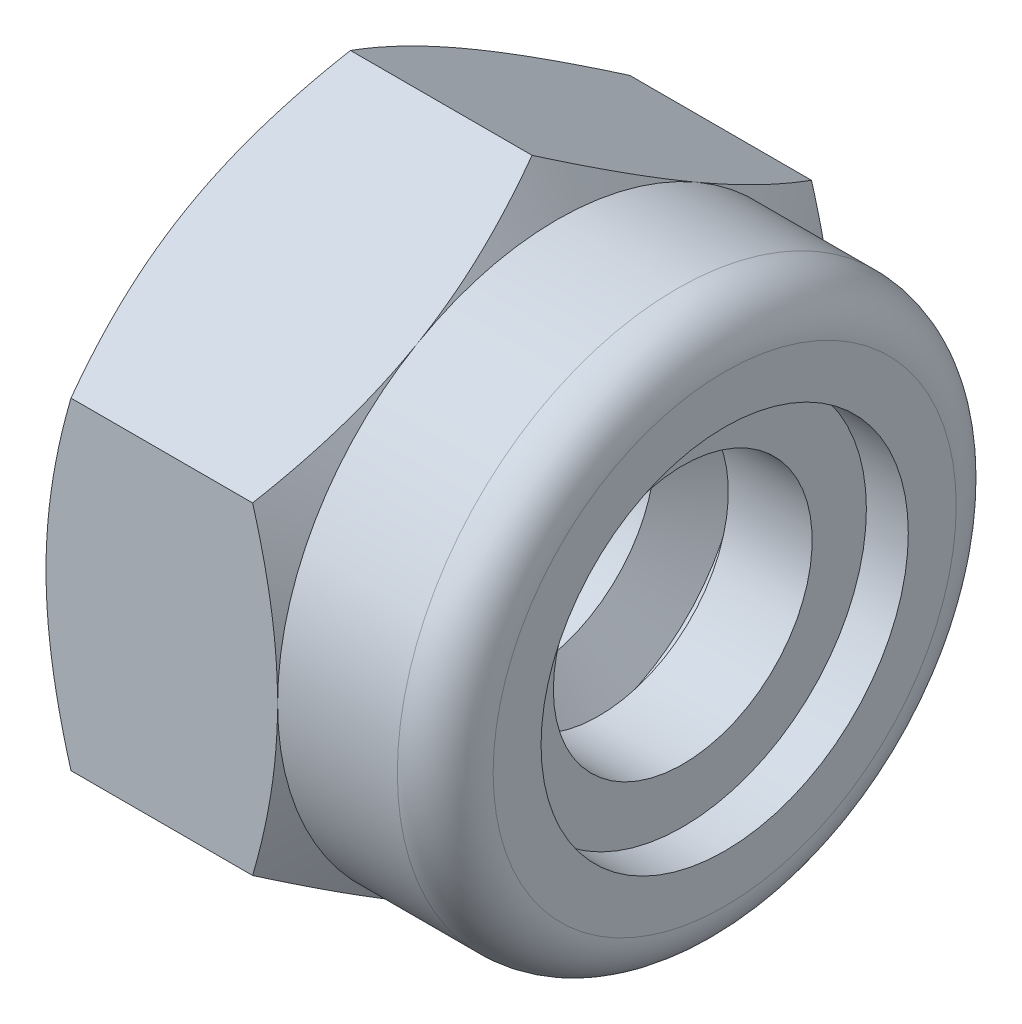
ISO-10303-21;
HEADER;
FILE_DESCRIPTION(('STEP AP214'),'2;1');
FILE_NAME('part.step','',(''),(''),'','','');
FILE_SCHEMA(('AUTOMOTIVE_DESIGN { 1 0 10303 214 1 1 1 1 }'));
ENDSEC;
DATA;
#1=APPLICATION_CONTEXT('core data for automotive mechanical design processes');
#2=APPLICATION_PROTOCOL_DEFINITION('international standard','automotive_design',2000,#1);
#3=PRODUCT_CONTEXT('',#1,'mechanical');
#4=PRODUCT('Part','Part','',(#3));
#5=PRODUCT_RELATED_PRODUCT_CATEGORY('part','',(#4));
#6=PRODUCT_DEFINITION_FORMATION('','',#4);
#7=PRODUCT_DEFINITION_CONTEXT('part definition',#1,'design');
#8=PRODUCT_DEFINITION('design','',#6,#7);
#9=PRODUCT_DEFINITION_SHAPE('','',#8);
#10=(LENGTH_UNIT() NAMED_UNIT(*) SI_UNIT(.MILLI.,.METRE.));
#11=(NAMED_UNIT(*) PLANE_ANGLE_UNIT() SI_UNIT($,.RADIAN.));
#12=(NAMED_UNIT(*) SI_UNIT($,.STERADIAN.) SOLID_ANGLE_UNIT());
#13=UNCERTAINTY_MEASURE_WITH_UNIT(LENGTH_MEASURE(1.E-05),#10,'distance_accuracy_value','');
#14=(GEOMETRIC_REPRESENTATION_CONTEXT(3) GLOBAL_UNCERTAINTY_ASSIGNED_CONTEXT((#13)) GLOBAL_UNIT_ASSIGNED_CONTEXT((#10,
#11,#12)) REPRESENTATION_CONTEXT('',''));
#15=CARTESIAN_POINT('',(0.,0.,0.));
#16=DIRECTION('',(0.,0.,1.));
#17=DIRECTION('',(1.,0.,0.));
#18=AXIS2_PLACEMENT_3D('',#15,#16,#17);
#19=CARTESIAN_POINT('',(4.47500000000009,1.9605,2.22044604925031E-13));
#20=DIRECTION('',(1.,0.,0.));
#21=DIRECTION('',(0.,0.,-1.));
#22=AXIS2_PLACEMENT_3D('',#19,#20,#21);
#23=PLANE('',#22);
#24=CARTESIAN_POINT('',(4.47499999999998,0.,0.));
#25=DIRECTION('',(-1.,0.,0.));
#26=DIRECTION('',(0.,0.,1.));
#27=AXIS2_PLACEMENT_3D('',#24,#25,#26);
#28=CIRCLE('',#27,2.3);
#29=CARTESIAN_POINT('',(4.47499999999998,0.,2.3));
#30=VERTEX_POINT('',#29);
#31=EDGE_CURVE('E20',#30,#30,#28,.F.);
#32=ORIENTED_EDGE('',*,*,#31,.T.);
#33=EDGE_LOOP('',(#32));
#34=FACE_BOUND('',#33,.T.);
#35=CARTESIAN_POINT('',(4.47499999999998,0.,0.));
#36=DIRECTION('',(-1.,0.,0.));
#37=DIRECTION('',(0.,0.,1.));
#38=AXIS2_PLACEMENT_3D('',#35,#36,#37);
#39=CIRCLE('',#38,1.621);
#40=CARTESIAN_POINT('',(4.47499999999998,0.,1.621));
#41=VERTEX_POINT('',#40);
#42=EDGE_CURVE('E635',#41,#41,#39,.T.);
#43=ORIENTED_EDGE('',*,*,#42,.T.);
#44=EDGE_LOOP('',(#43));
#45=FACE_BOUND('',#44,.T.);
#46=ADVANCED_FACE('F16',(#34,#45),#23,.T.);
#47=CARTESIAN_POINT('',(4.73749999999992,0.,1.11022302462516E-13));
#48=DIRECTION('',(-1.,0.,0.));
#49=DIRECTION('',(0.,0.,1.));
#50=AXIS2_PLACEMENT_3D('',#47,#48,#49);
#51=CYLINDRICAL_SURFACE('',#50,2.3);
#52=ORIENTED_EDGE('',*,*,#31,.F.);
#53=EDGE_LOOP('',(#52));
#54=FACE_BOUND('',#53,.T.);
#55=CARTESIAN_POINT('',(4.99999999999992,0.,1.11022302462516E-13));
#56=DIRECTION('',(-1.,0.,0.));
#57=DIRECTION('',(0.,0.,1.));
#58=AXIS2_PLACEMENT_3D('',#55,#56,#57);
#59=CIRCLE('',#58,2.3);
#60=CARTESIAN_POINT('',(4.99999999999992,0.,2.30000000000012));
#61=VERTEX_POINT('',#60);
#62=EDGE_CURVE('E636',#61,#61,#59,.T.);
#63=ORIENTED_EDGE('',*,*,#62,.F.);
#64=EDGE_LOOP('',(#63));
#65=FACE_BOUND('',#64,.T.);
#66=ADVANCED_FACE('F609',(#54,#65),#51,.F.);
#67=CARTESIAN_POINT('',(3.94999999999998,0.,-1.11022302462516E-13));
#68=DIRECTION('',(-1.,0.,0.));
#69=DIRECTION('',(0.,0.,1.));
#70=AXIS2_PLACEMENT_3D('',#67,#68,#69);
#71=CYLINDRICAL_SURFACE('',#70,1.621);
#72=ORIENTED_EDGE('',*,*,#42,.F.);
#73=EDGE_LOOP('',(#72));
#74=FACE_BOUND('',#73,.T.);
#75=CARTESIAN_POINT('',(3.4249999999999,0.,2.22044604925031E-13));
#76=DIRECTION('',(-1.,0.,0.));
#77=DIRECTION('',(0.,0.,1.));
#78=AXIS2_PLACEMENT_3D('',#75,#76,#77);
#79=CIRCLE('',#78,1.621);
#80=CARTESIAN_POINT('',(3.4249999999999,0.,1.62100000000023));
#81=VERTEX_POINT('',#80);
#82=EDGE_CURVE('E638',#81,#81,#79,.F.);
#83=ORIENTED_EDGE('',*,*,#82,.F.);
#84=EDGE_LOOP('',(#83));
#85=FACE_BOUND('',#84,.T.);
#86=ADVANCED_FACE('F601',(#74,#85),#71,.F.);
#87=CARTESIAN_POINT('',(5.00000000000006,2.59999999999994,2.22044604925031E-13));
#88=DIRECTION('',(1.,0.,0.));
#89=DIRECTION('',(0.,0.,-1.));
#90=AXIS2_PLACEMENT_3D('',#87,#88,#89);
#91=PLANE('',#90);
#92=CARTESIAN_POINT('',(5.0000000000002,0.,0.));
#93=DIRECTION('',(-1.,0.,0.));
#94=DIRECTION('',(0.,0.,1.));
#95=AXIS2_PLACEMENT_3D('',#92,#93,#94);
#96=CIRCLE('',#95,2.8999999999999);
#97=CARTESIAN_POINT('',(5.0000000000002,0.,2.89999999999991));
#98=VERTEX_POINT('',#97);
#99=EDGE_CURVE('E642',#98,#98,#96,.T.);
#100=ORIENTED_EDGE('',*,*,#99,.F.);
#101=EDGE_LOOP('',(#100));
#102=FACE_BOUND('',#101,.T.);
#103=ORIENTED_EDGE('',*,*,#62,.T.);
#104=EDGE_LOOP('',(#103));
#105=FACE_BOUND('',#104,.T.);
#106=ADVANCED_FACE('F593',(#102,#105),#91,.T.);
#107=CARTESIAN_POINT('',(3.42500000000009,1.9605,0.));
#108=DIRECTION('',(-1.,0.,0.));
#109=DIRECTION('',(0.,0.,1.));
#110=AXIS2_PLACEMENT_3D('',#107,#108,#109);
#111=PLANE('',#110);
#112=CARTESIAN_POINT('',(3.4249999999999,0.,2.22044604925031E-13));
#113=DIRECTION('',(-1.,0.,0.));
#114=DIRECTION('',(0.,0.,1.));
#115=AXIS2_PLACEMENT_3D('',#112,#113,#114);
#116=CIRCLE('',#115,2.3);
#117=CARTESIAN_POINT('',(3.4249999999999,0.,2.30000000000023));
#118=VERTEX_POINT('',#117);
#119=EDGE_CURVE('E171',#118,#118,#116,.T.);
#120=ORIENTED_EDGE('',*,*,#119,.T.);
#121=EDGE_LOOP('',(#120));
#122=FACE_BOUND('',#121,.T.);
#123=ORIENTED_EDGE('',*,*,#82,.T.);
#124=EDGE_LOOP('',(#123));
#125=FACE_BOUND('',#124,.T.);
#126=ADVANCED_FACE('F586',(#122,#125),#111,.T.);
#127=CARTESIAN_POINT('',(4.40000000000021,0.,-2.22044604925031E-13));
#128=DIRECTION('',(-1.,0.,0.));
#129=DIRECTION('',(0.,0.,1.));
#130=AXIS2_PLACEMENT_3D('',#127,#128,#129);
#131=TOROIDAL_SURFACE('',#130,2.89999999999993,0.599999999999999);
#132=CARTESIAN_POINT('',(4.40000000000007,0.,0.));
#133=DIRECTION('',(-1.,0.,0.));
#134=DIRECTION('',(0.,0.,1.));
#135=AXIS2_PLACEMENT_3D('',#132,#133,#134);
#136=CIRCLE('',#135,3.5);
#137=CARTESIAN_POINT('',(4.40000000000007,0.,3.50000000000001));
#138=VERTEX_POINT('',#137);
#139=EDGE_CURVE('E169',#138,#138,#136,.T.);
#140=ORIENTED_EDGE('',*,*,#139,.F.);
#141=EDGE_LOOP('',(#140));
#142=FACE_BOUND('',#141,.T.);
#143=ORIENTED_EDGE('',*,*,#99,.T.);
#144=EDGE_LOOP('',(#143));
#145=FACE_BOUND('',#144,.T.);
#146=ADVANCED_FACE('F18',(#142,#145),#131,.T.);
#147=CARTESIAN_POINT('',(3.16250000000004,0.,0.));
#148=DIRECTION('',(-1.,0.,0.));
#149=DIRECTION('',(0.,0.,1.));
#150=AXIS2_PLACEMENT_3D('',#147,#148,#149);
#151=CYLINDRICAL_SURFACE('',#150,2.3);
#152=ORIENTED_EDGE('',*,*,#119,.F.);
#153=EDGE_LOOP('',(#152));
#154=FACE_BOUND('',#153,.T.);
#155=CARTESIAN_POINT('',(2.89999999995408,0.,0.));
#156=DIRECTION('',(1.,0.,0.));
#157=DIRECTION('',(0.,1.,0.));
#158=AXIS2_PLACEMENT_3D('',#155,#156,#157);
#159=CIRCLE('',#158,2.29999999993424);
#160=CARTESIAN_POINT('',(2.89999999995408,0.,-2.29999999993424));
#161=VERTEX_POINT('',#160);
#162=EDGE_CURVE('E164',#161,#161,#159,.F.);
#163=ORIENTED_EDGE('',*,*,#162,.T.);
#164=EDGE_LOOP('',(#163));
#165=FACE_BOUND('',#164,.T.);
#166=ADVANCED_FACE('F573',(#154,#165),#151,.F.);
#167=CARTESIAN_POINT('',(3.64999999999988,0.,0.));
#168=DIRECTION('',(-1.,0.,0.));
#169=DIRECTION('',(0.,0.,1.));
#170=AXIS2_PLACEMENT_3D('',#167,#168,#169);
#171=CYLINDRICAL_SURFACE('',#170,3.5);
#172=CARTESIAN_POINT('',(2.89999999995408,0.,0.));
#173=DIRECTION('',(-1.,0.,0.));
#174=DIRECTION('',(0.,-1.,0.));
#175=AXIS2_PLACEMENT_3D('',#172,#173,#174);
#176=CIRCLE('',#175,3.49999999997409);
#177=CARTESIAN_POINT('',(2.89999999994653,3.03108891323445,1.74999999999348));
#178=VERTEX_POINT('',#177);
#179=CARTESIAN_POINT('',(2.89999999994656,3.03108891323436,-1.74999999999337));
#180=VERTEX_POINT('',#179);
#181=EDGE_CURVE('E158',#178,#180,#176,.T.);
#182=ORIENTED_EDGE('',*,*,#181,.F.);
#183=CARTESIAN_POINT('',(2.89999999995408,0.,0.));
#184=DIRECTION('',(-1.,0.,0.));
#185=DIRECTION('',(0.,-1.,0.));
#186=AXIS2_PLACEMENT_3D('',#183,#184,#185);
#187=CIRCLE('',#186,3.49999999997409);
#188=CARTESIAN_POINT('',(2.89999999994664,0.,3.49999999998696));
#189=VERTEX_POINT('',#188);
#190=EDGE_CURVE('E112',#189,#178,#187,.T.);
#191=ORIENTED_EDGE('',*,*,#190,.F.);
#192=CARTESIAN_POINT('',(2.89999999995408,0.,0.));
#193=DIRECTION('',(-1.,0.,0.));
#194=DIRECTION('',(0.,-1.,0.));
#195=AXIS2_PLACEMENT_3D('',#192,#193,#194);
#196=CIRCLE('',#195,3.49999999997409);
#197=CARTESIAN_POINT('',(2.89999999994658,-3.03108891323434,1.74999999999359));
#198=VERTEX_POINT('',#197);
#199=EDGE_CURVE('E148',#198,#189,#196,.T.);
#200=ORIENTED_EDGE('',*,*,#199,.F.);
#201=CARTESIAN_POINT('',(2.89999999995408,0.,0.));
#202=DIRECTION('',(-1.,0.,0.));
#203=DIRECTION('',(0.,-1.,0.));
#204=AXIS2_PLACEMENT_3D('',#201,#202,#203);
#205=CIRCLE('',#204,3.49999999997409);
#206=CARTESIAN_POINT('',(2.89999999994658,-3.03108891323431,-1.7499999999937));
#207=VERTEX_POINT('',#206);
#208=EDGE_CURVE('E145',#207,#198,#205,.T.);
#209=ORIENTED_EDGE('',*,*,#208,.F.);
#210=CARTESIAN_POINT('',(2.89999999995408,0.,0.));
#211=DIRECTION('',(-1.,0.,0.));
#212=DIRECTION('',(0.,-1.,0.));
#213=AXIS2_PLACEMENT_3D('',#210,#211,#212);
#214=CIRCLE('',#213,3.49999999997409);
#215=CARTESIAN_POINT('',(2.89999999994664,0.,-3.49999999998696));
#216=VERTEX_POINT('',#215);
#217=EDGE_CURVE('E152',#216,#207,#214,.T.);
#218=ORIENTED_EDGE('',*,*,#217,.F.);
#219=CARTESIAN_POINT('',(2.89999999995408,0.,0.));
#220=DIRECTION('',(-1.,0.,0.));
#221=DIRECTION('',(0.,-1.,0.));
#222=AXIS2_PLACEMENT_3D('',#219,#220,#221);
#223=CIRCLE('',#222,3.49999999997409);
#224=EDGE_CURVE('E155',#180,#216,#223,.T.);
#225=ORIENTED_EDGE('',*,*,#224,.F.);
#226=EDGE_LOOP('',(#182,#191,#200,#209,#218,#225));
#227=FACE_BOUND('',#226,.T.);
#228=ORIENTED_EDGE('',*,*,#139,.T.);
#229=EDGE_LOOP('',(#228));
#230=FACE_BOUND('',#229,.T.);
#231=ADVANCED_FACE('F566',(#227,#230),#171,.T.);
#232=CARTESIAN_POINT('',(2.89999999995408,0.,0.));
#233=DIRECTION('',(1.,0.,0.));
#234=DIRECTION('',(0.,0.,-1.));
#235=AXIS2_PLACEMENT_3D('',#232,#233,#234);
#236=CONICAL_SURFACE('',#235,2.29999999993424,1.04719755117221);
#237=CARTESIAN_POINT('',(2.50797916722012,0.,1.11022302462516E-13));
#238=DIRECTION('',(-1.,0.,0.));
#239=DIRECTION('',(0.,0.,1.));
#240=AXIS2_PLACEMENT_3D('',#237,#238,#239);
#241=CIRCLE('',#240,1.621);
#242=CARTESIAN_POINT('',(2.50797916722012,0.,-1.62100000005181));
#243=VERTEX_POINT('',#242);
#244=EDGE_CURVE('E125',#243,#243,#241,.T.);
#245=CARTESIAN_POINT('',(2.50797916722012,0.,-1.62100000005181));
#246=CARTESIAN_POINT('',(2.5120627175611,0.,-1.62807291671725));
#247=CARTESIAN_POINT('',(2.51614626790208,0.,-1.63514583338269));
#248=CARTESIAN_POINT('',(2.52431336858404,0.,-1.64929166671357));
#249=CARTESIAN_POINT('',(2.52839691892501,0.,-1.65636458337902));
#250=CARTESIAN_POINT('',(2.53656401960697,0.,-1.6705104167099));
#251=CARTESIAN_POINT('',(2.54064756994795,0.,-1.67758333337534));
#252=CARTESIAN_POINT('',(2.54881467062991,0.,-1.69172916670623));
#253=CARTESIAN_POINT('',(2.55289822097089,0.,-1.69880208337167));
#254=CARTESIAN_POINT('',(2.56106532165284,0.,-1.71294791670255));
#255=CARTESIAN_POINT('',(2.56514887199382,0.,-1.72002083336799));
#256=CARTESIAN_POINT('',(2.57331597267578,0.,-1.73416666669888));
#257=CARTESIAN_POINT('',(2.57739952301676,0.,-1.74123958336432));
#258=CARTESIAN_POINT('',(2.58556662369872,0.,-1.7553854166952));
#259=CARTESIAN_POINT('',(2.5896501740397,0.,-1.76245833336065));
#260=CARTESIAN_POINT('',(2.59781727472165,0.,-1.77660416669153));
#261=CARTESIAN_POINT('',(2.60190082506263,0.,-1.78367708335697));
#262=CARTESIAN_POINT('',(2.61006792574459,0.,-1.79782291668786));
#263=CARTESIAN_POINT('',(2.61415147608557,0.,-1.8048958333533));
#264=CARTESIAN_POINT('',(2.62231857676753,0.,-1.81904166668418));
#265=CARTESIAN_POINT('',(2.6264021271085,0.,-1.82611458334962));
#266=CARTESIAN_POINT('',(2.63456922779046,0.,-1.84026041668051));
#267=CARTESIAN_POINT('',(2.63865277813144,0.,-1.84733333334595));
#268=CARTESIAN_POINT('',(2.6468198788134,0.,-1.86147916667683));
#269=CARTESIAN_POINT('',(2.65090342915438,0.,-1.86855208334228));
#270=CARTESIAN_POINT('',(2.65907052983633,0.,-1.88269791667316));
#271=CARTESIAN_POINT('',(2.66315408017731,0.,-1.8897708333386));
#272=CARTESIAN_POINT('',(2.67132118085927,0.,-1.90391666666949));
#273=CARTESIAN_POINT('',(2.67540473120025,0.,-1.91098958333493));
#274=CARTESIAN_POINT('',(2.68357183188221,0.,-1.92513541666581));
#275=CARTESIAN_POINT('',(2.68765538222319,0.,-1.93220833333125));
#276=CARTESIAN_POINT('',(2.69582248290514,0.,-1.94635416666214));
#277=CARTESIAN_POINT('',(2.69990603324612,0.,-1.95342708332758));
#278=CARTESIAN_POINT('',(2.70807313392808,0.,-1.96757291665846));
#279=CARTESIAN_POINT('',(2.71215668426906,0.,-1.97464583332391));
#280=CARTESIAN_POINT('',(2.72032378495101,0.,-1.98879166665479));
#281=CARTESIAN_POINT('',(2.72440733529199,0.,-1.99586458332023));
#282=CARTESIAN_POINT('',(2.73257443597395,0.,-2.01001041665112));
#283=CARTESIAN_POINT('',(2.73665798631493,0.,-2.01708333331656));
#284=CARTESIAN_POINT('',(2.74482508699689,0.,-2.03122916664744));
#285=CARTESIAN_POINT('',(2.74890863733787,0.,-2.03830208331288));
#286=CARTESIAN_POINT('',(2.75707573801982,0.,-2.05244791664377));
#287=CARTESIAN_POINT('',(2.7611592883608,0.,-2.05952083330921));
#288=CARTESIAN_POINT('',(2.76932638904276,0.,-2.07366666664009));
#289=CARTESIAN_POINT('',(2.77340993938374,0.,-2.08073958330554));
#290=CARTESIAN_POINT('',(2.7815770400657,0.,-2.09488541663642));
#291=CARTESIAN_POINT('',(2.78566059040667,0.,-2.10195833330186));
#292=CARTESIAN_POINT('',(2.79382769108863,0.,-2.11610416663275));
#293=CARTESIAN_POINT('',(2.79791124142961,0.,-2.12317708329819));
#294=CARTESIAN_POINT('',(2.80607834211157,0.,-2.13732291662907));
#295=CARTESIAN_POINT('',(2.81016189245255,0.,-2.14439583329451));
#296=CARTESIAN_POINT('',(2.8183289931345,0.,-2.1585416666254));
#297=CARTESIAN_POINT('',(2.82241254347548,0.,-2.16561458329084));
#298=CARTESIAN_POINT('',(2.83057964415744,0.,-2.17976041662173));
#299=CARTESIAN_POINT('',(2.83466319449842,0.,-2.18683333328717));
#300=CARTESIAN_POINT('',(2.84283029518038,0.,-2.20097916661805));
#301=CARTESIAN_POINT('',(2.84691384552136,0.,-2.20805208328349));
#302=CARTESIAN_POINT('',(2.85508094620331,0.,-2.22219791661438));
#303=CARTESIAN_POINT('',(2.85916449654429,0.,-2.22927083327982));
#304=CARTESIAN_POINT('',(2.86733159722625,0.,-2.2434166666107));
#305=CARTESIAN_POINT('',(2.87141514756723,0.,-2.25048958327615));
#306=CARTESIAN_POINT('',(2.87958224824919,0.,-2.26463541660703));
#307=CARTESIAN_POINT('',(2.88366579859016,0.,-2.27170833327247));
#308=CARTESIAN_POINT('',(2.89183289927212,0.,-2.28585416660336));
#309=CARTESIAN_POINT('',(2.8959164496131,0.,-2.2929270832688));
#310=CARTESIAN_POINT('',(2.89999999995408,0.,-2.29999999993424));
#311=B_SPLINE_CURVE_WITH_KNOTS('',3,(#245,#246,#247,#248,#249,#250,#251,#252,#253,#254,#255,
#256,#257,#258,#259,#260,#261,#262,#263,#264,#265,#266,#267,#268,#269,#270,#271,#272,#273,#274,
#275,#276,#277,#278,#279,#280,#281,#282,#283,#284,#285,#286,#287,#288,#289,#290,#291,#292,#293,
#294,#295,#296,#297,#298,#299,#300,#301,#302,#303,#304,#305,#306,#307,#308,#309,#310),
.UNSPECIFIED.,.F.,.F.,(4,2,2,2,2,2,2,2,2,2,2,2,2,2,2,2,2,2,2,2,2,2,2,2,2,2,2,2,2,2,2,2,4),(0.,
0.0245013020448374,0.049002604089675,0.0735039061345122,0.0980052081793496,0.122506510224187,
0.147007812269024,0.171509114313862,0.196010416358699,0.220511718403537,0.245013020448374,
0.269514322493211,0.294015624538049,0.318516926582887,0.343018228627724,0.367519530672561,
0.392020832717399,0.416522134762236,0.441023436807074,0.465524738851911,0.490026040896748,
0.514527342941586,0.539028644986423,0.56352994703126,0.588031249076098,0.612532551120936,
0.637033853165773,0.661535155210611,0.686036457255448,0.710537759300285,0.735039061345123,
0.75954036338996,0.784041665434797),.UNSPECIFIED.);
#312=EDGE_CURVE('BSEAM320',#243,#161,#311,.T.);
#313=ORIENTED_EDGE('',*,*,#244,.T.);
#314=ORIENTED_EDGE('',*,*,#162,.F.);
#315=ORIENTED_EDGE('',*,*,#312,.T.);
#316=ORIENTED_EDGE('',*,*,#312,.F.);
#317=EDGE_LOOP('',(#313,#315,#314,#316));
#318=FACE_BOUND('',#317,.T.);
#319=ADVANCED_FACE('F320',(#318),#236,.F.);
#320=CARTESIAN_POINT('',(2.58551696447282,0.,2.22044604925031E-13));
#321=DIRECTION('',(-1.,0.,0.));
#322=DIRECTION('',(0.,0.,1.));
#323=AXIS2_PLACEMENT_3D('',#320,#321,#322);
#324=CONICAL_SURFACE('',#323,4.04470059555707,1.04719755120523);
#325=CARTESIAN_POINT('',(2.89999999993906,3.03108891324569,1.75000000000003));
#326=CARTESIAN_POINT('',(2.9000143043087,2.98820467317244,1.8242776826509));
#327=CARTESIAN_POINT('',(2.89818014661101,2.94532249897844,1.89855178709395));
#328=CARTESIAN_POINT('',(2.89092122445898,2.85964235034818,2.04695415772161));
#329=CARTESIAN_POINT('',(2.8854971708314,2.816844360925,2.12108244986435));
#330=CARTESIAN_POINT('',(2.87120049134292,2.73160902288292,2.26871438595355));
#331=CARTESIAN_POINT('',(2.86234522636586,2.68917094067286,2.34221930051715));
#332=CARTESIAN_POINT('',(2.84137660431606,2.60449696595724,2.48887892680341));
#333=CARTESIAN_POINT('',(2.82926316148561,2.56226107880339,2.56203362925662));
#334=CARTESIAN_POINT('',(2.7884097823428,2.43603178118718,2.78066918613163));
#335=CARTESIAN_POINT('',(2.75513695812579,2.35240507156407,2.92551489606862));
#336=CARTESIAN_POINT('',(2.67840131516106,2.18587080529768,3.2139607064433));
#337=CARTESIAN_POINT('',(2.63488760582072,2.10296905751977,3.35755074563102));
#338=CARTESIAN_POINT('',(2.58739260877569,2.02072594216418,3.49999999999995));
#339=B_SPLINE_CURVE_WITH_KNOTS('',3,(#325,#326,#327,#328,#329,#330,#331,#332,#333,#334,#335,
#336,#337,#338),.UNSPECIFIED.,.F.,.F.,(4,2,2,2,2,2,4),(0.,0.257279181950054,0.514507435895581,
0.770450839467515,1.02640098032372,1.53763042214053,2.05145608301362),.UNSPECIFIED.);
#340=CARTESIAN_POINT('',(2.58739260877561,2.02072594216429,3.49999999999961));
#341=VERTEX_POINT('',#340);
#342=EDGE_CURVE('E106',#178,#341,#339,.T.);
#343=ORIENTED_EDGE('',*,*,#342,.T.);
#344=CARTESIAN_POINT('',(2.58739260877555,2.0207259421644,3.49999999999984));
#345=CARTESIAN_POINT('',(2.63488760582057,1.85623971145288,3.49999999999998));
#346=CARTESIAN_POINT('',(2.67840131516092,1.69043621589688,3.50000000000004));
#347=CARTESIAN_POINT('',(2.75513695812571,1.35736768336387,3.50000000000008));
#348=CARTESIAN_POINT('',(2.78840978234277,1.19011426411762,3.50000000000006));
#349=CARTESIAN_POINT('',(2.82926316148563,0.93765566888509,3.50000000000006));
#350=CARTESIAN_POINT('',(2.84137660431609,0.853183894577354,3.50000000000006));
#351=CARTESIAN_POINT('',(2.86234522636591,0.683835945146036,3.50000000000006));
#352=CARTESIAN_POINT('',(2.87120049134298,0.59895978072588,3.50000000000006));
#353=CARTESIAN_POINT('',(2.88549717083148,0.428489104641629,3.50000000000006));
#354=CARTESIAN_POINT('',(2.89092122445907,0.342893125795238,3.50000000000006));
#355=CARTESIAN_POINT('',(2.89818014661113,0.171532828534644,3.50000000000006));
#356=CARTESIAN_POINT('',(2.90001430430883,0.0857684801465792,3.50000000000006));
#357=CARTESIAN_POINT('',(2.89999999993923,0.,3.50000000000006));
#358=B_SPLINE_CURVE_WITH_KNOTS('',3,(#344,#345,#346,#347,#348,#349,#350,#351,#352,#353,#354,
#355,#356,#357),.UNSPECIFIED.,.F.,.F.,(4,2,2,2,2,2,4),(0.,0.513825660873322,1.02505510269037,
1.2810052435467,1.53694864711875,1.7941769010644,2.05145608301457),.UNSPECIFIED.);
#359=EDGE_CURVE('E109',#341,#189,#358,.T.);
#360=ORIENTED_EDGE('',*,*,#359,.T.);
#361=ORIENTED_EDGE('',*,*,#190,.T.);
#362=EDGE_LOOP('',(#343,#360,#361));
#363=FACE_BOUND('',#362,.T.);
#364=ADVANCED_FACE('F108',(#363),#324,.T.);
#365=CARTESIAN_POINT('',(2.58551696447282,0.,2.22044604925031E-13));
#366=DIRECTION('',(-1.,0.,0.));
#367=DIRECTION('',(0.,0.,1.));
#368=AXIS2_PLACEMENT_3D('',#365,#366,#367);
#369=CONICAL_SURFACE('',#368,4.04470059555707,1.04719755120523);
#370=CARTESIAN_POINT('',(2.58739260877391,4.04145188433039,-4.66293670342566E-12));
#371=CARTESIAN_POINT('',(2.63488760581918,3.95920876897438,0.142449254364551));
#372=CARTESIAN_POINT('',(2.67840131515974,3.87630702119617,0.28603929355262));
#373=CARTESIAN_POINT('',(2.75513695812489,3.70977275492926,0.574485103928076));
#374=CARTESIAN_POINT('',(2.78840978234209,3.62614604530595,0.719330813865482));
#375=CARTESIAN_POINT('',(2.82926316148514,3.49991674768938,0.937966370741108));
#376=CARTESIAN_POINT('',(2.84137660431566,3.45768086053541,1.01112107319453));
#377=CARTESIAN_POINT('',(2.86234522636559,3.37300688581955,1.1577806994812));
#378=CARTESIAN_POINT('',(2.87120049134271,3.33056880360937,1.23128561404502));
#379=CARTESIAN_POINT('',(2.88549717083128,3.24533346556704,1.37891755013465));
#380=CARTESIAN_POINT('',(2.8909212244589,3.20253547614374,1.4530458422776));
#381=CARTESIAN_POINT('',(2.89818014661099,3.11685532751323,1.60144821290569));
#382=CARTESIAN_POINT('',(2.90001430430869,3.07397315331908,1.67572231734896));
#383=CARTESIAN_POINT('',(2.89999999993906,3.03108891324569,1.75000000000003));
#384=B_SPLINE_CURVE_WITH_KNOTS('',3,(#370,#371,#372,#373,#374,#375,#376,#377,#378,#379,#380,
#381,#382,#383),.UNSPECIFIED.,.F.,.F.,(4,2,2,2,2,2,4),(0.,0.513825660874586,1.02505510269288,
1.28100524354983,1.53694864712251,1.79417690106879,2.0514560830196),.UNSPECIFIED.);
#385=CARTESIAN_POINT('',(2.58739260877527,4.04145188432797,-3.88578058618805E-12));
#386=VERTEX_POINT('',#385);
#387=EDGE_CURVE('E117',#386,#178,#384,.T.);
#388=ORIENTED_EDGE('',*,*,#387,.T.);
#389=ORIENTED_EDGE('',*,*,#181,.T.);
#390=CARTESIAN_POINT('',(2.89999999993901,3.03108891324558,-1.74999999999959));
#391=CARTESIAN_POINT('',(2.90001430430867,3.07397315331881,-1.67572231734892));
#392=CARTESIAN_POINT('',(2.898180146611,3.11685532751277,-1.60144821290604));
#393=CARTESIAN_POINT('',(2.890921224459,3.20253547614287,-1.45304584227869));
#394=CARTESIAN_POINT('',(2.88549717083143,3.24533346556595,-1.37891755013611));
#395=CARTESIAN_POINT('',(2.87120049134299,3.33056880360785,-1.2312856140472));
#396=CARTESIAN_POINT('',(2.86234522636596,3.37300688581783,-1.15778069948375));
#397=CARTESIAN_POINT('',(2.84137660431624,3.45768086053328,-1.01112107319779));
#398=CARTESIAN_POINT('',(2.82926316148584,3.49991674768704,-0.937966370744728));
#399=CARTESIAN_POINT('',(2.78840978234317,3.62614604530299,-0.719330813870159));
#400=CARTESIAN_POINT('',(2.75513695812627,3.70977275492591,-0.574485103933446));
#401=CARTESIAN_POINT('',(2.67840131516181,3.87630702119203,-0.286039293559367));
#402=CARTESIAN_POINT('',(2.63488760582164,3.95920876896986,-0.14244925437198));
#403=CARTESIAN_POINT('',(2.5873926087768,4.0414518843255,-3.44169137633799E-12));
#404=B_SPLINE_CURVE_WITH_KNOTS('',3,(#390,#391,#392,#393,#394,#395,#396,#397,#398,#399,#400,
#401,#402,#403),.UNSPECIFIED.,.F.,.F.,(4,2,2,2,2,2,4),(0.,0.257279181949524,0.514507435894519,
0.770450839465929,1.02640098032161,1.53763042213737,2.0514560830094),.UNSPECIFIED.);
#405=EDGE_CURVE('E134',#180,#386,#404,.T.);
#406=ORIENTED_EDGE('',*,*,#405,.T.);
#407=EDGE_LOOP('',(#388,#389,#406));
#408=FACE_BOUND('',#407,.T.);
#409=ADVANCED_FACE('F290',(#408),#369,.T.);
#410=CARTESIAN_POINT('',(2.58551696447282,0.,2.22044604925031E-13));
#411=DIRECTION('',(-1.,0.,0.));
#412=DIRECTION('',(0.,0.,1.));
#413=AXIS2_PLACEMENT_3D('',#410,#411,#412);
#414=CONICAL_SURFACE('',#413,4.04470059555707,1.04719755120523);
#415=ORIENTED_EDGE('',*,*,#224,.T.);
#416=CARTESIAN_POINT('',(2.8999999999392,0.,-3.49999999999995));
#417=CARTESIAN_POINT('',(2.9000143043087,0.0857684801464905,-3.49999999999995));
#418=CARTESIAN_POINT('',(2.89818014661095,0.171532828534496,-3.49999999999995));
#419=CARTESIAN_POINT('',(2.89092122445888,0.342893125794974,-3.49999999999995));
#420=CARTESIAN_POINT('',(2.88549717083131,0.428489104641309,-3.49999999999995));
#421=CARTESIAN_POINT('',(2.87120049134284,0.59895978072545,-3.49999999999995));
#422=CARTESIAN_POINT('',(2.86234522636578,0.683835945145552,-3.49999999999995));
#423=CARTESIAN_POINT('',(2.84137660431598,0.853183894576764,-3.49999999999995));
#424=CARTESIAN_POINT('',(2.82926316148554,0.937655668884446,-3.49999999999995));
#425=CARTESIAN_POINT('',(2.78840978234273,1.19011426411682,-3.49999999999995));
#426=CARTESIAN_POINT('',(2.75513695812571,1.35736768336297,-3.49999999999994));
#427=CARTESIAN_POINT('',(2.67840131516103,1.69043621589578,-3.49999999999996));
#428=CARTESIAN_POINT('',(2.63488760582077,1.85623971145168,-3.49999999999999));
#429=CARTESIAN_POINT('',(2.58739260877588,2.02072594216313,-3.50000000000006));
#430=B_SPLINE_CURVE_WITH_KNOTS('',3,(#416,#417,#418,#419,#420,#421,#422,#423,#424,#425,#426,
#427,#428,#429),.UNSPECIFIED.,.F.,.F.,(4,2,2,2,2,2,4),(0.,0.257279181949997,0.514507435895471,
0.770450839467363,1.02640098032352,1.53763042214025,2.05145608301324),.UNSPECIFIED.);
#431=CARTESIAN_POINT('',(2.58739260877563,2.02072594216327,-3.50000000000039));
#432=VERTEX_POINT('',#431);
#433=EDGE_CURVE('E263',#216,#432,#430,.T.);
#434=ORIENTED_EDGE('',*,*,#433,.T.);
#435=CARTESIAN_POINT('',(2.58739260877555,2.02072594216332,-3.5000000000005));
#436=CARTESIAN_POINT('',(2.63488760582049,2.10296905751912,-3.35755074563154));
#437=CARTESIAN_POINT('',(2.67840131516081,2.18587080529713,-3.21396070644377));
#438=CARTESIAN_POINT('',(2.75513695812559,2.35240507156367,-2.92551489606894));
#439=CARTESIAN_POINT('',(2.78840978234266,2.4360317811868,-2.78066918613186));
#440=CARTESIAN_POINT('',(2.82926316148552,2.56226107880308,-2.56203362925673));
#441=CARTESIAN_POINT('',(2.84137660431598,2.60449696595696,-2.48887892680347));
#442=CARTESIAN_POINT('',(2.8623452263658,2.68917094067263,-2.34221930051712));
#443=CARTESIAN_POINT('',(2.87120049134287,2.73160902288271,-2.26871438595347));
#444=CARTESIAN_POINT('',(2.88549717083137,2.81684436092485,-2.12108244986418));
#445=CARTESIAN_POINT('',(2.89092122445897,2.85964235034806,-2.04695415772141));
#446=CARTESIAN_POINT('',(2.898180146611,2.94532249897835,-1.89855178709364));
#447=CARTESIAN_POINT('',(2.90001430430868,2.98820467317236,-1.82427768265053));
#448=CARTESIAN_POINT('',(2.89999999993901,3.03108891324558,-1.74999999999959));
#449=B_SPLINE_CURVE_WITH_KNOTS('',3,(#435,#436,#437,#438,#439,#440,#441,#442,#443,#444,#445,
#446,#447,#448),.UNSPECIFIED.,.F.,.F.,(4,2,2,2,2,2,4),(0.,0.513825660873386,1.0250551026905,
1.28100524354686,1.53694864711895,1.79417690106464,2.05145608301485),.UNSPECIFIED.);
#450=EDGE_CURVE('E131',#432,#180,#449,.T.);
#451=ORIENTED_EDGE('',*,*,#450,.T.);
#452=EDGE_LOOP('',(#415,#434,#451));
#453=FACE_BOUND('',#452,.T.);
#454=ADVANCED_FACE('F285',(#453),#414,.T.);
#455=CARTESIAN_POINT('',(2.58551696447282,0.,2.22044604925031E-13));
#456=DIRECTION('',(-1.,0.,0.));
#457=DIRECTION('',(0.,0.,1.));
#458=AXIS2_PLACEMENT_3D('',#455,#456,#457);
#459=CONICAL_SURFACE('',#458,4.04470059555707,1.04719755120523);
#460=ORIENTED_EDGE('',*,*,#217,.T.);
#461=CARTESIAN_POINT('',(2.89999999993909,-3.03108891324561,-1.75000000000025));
#462=CARTESIAN_POINT('',(2.90001430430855,-2.98820467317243,-1.82427768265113));
#463=CARTESIAN_POINT('',(2.89818014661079,-2.94532249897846,-1.89855178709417));
#464=CARTESIAN_POINT('',(2.89092122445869,-2.85964235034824,-2.04695415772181));
#465=CARTESIAN_POINT('',(2.88549717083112,-2.81684436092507,-2.12108244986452));
#466=CARTESIAN_POINT('',(2.87120049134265,-2.731609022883,-2.26871438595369));
#467=CARTESIAN_POINT('',(2.86234522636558,-2.68917094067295,-2.34221930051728));
#468=CARTESIAN_POINT('',(2.84137660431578,-2.60449696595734,-2.48887892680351));
#469=CARTESIAN_POINT('',(2.82926316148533,-2.5622610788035,-2.56203362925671));
#470=CARTESIAN_POINT('',(2.78840978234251,-2.43603178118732,-2.78066918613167));
#471=CARTESIAN_POINT('',(2.75513695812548,-2.35240507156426,-2.92551489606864));
#472=CARTESIAN_POINT('',(2.67840131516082,-2.18587080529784,-3.21396070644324));
#473=CARTESIAN_POINT('',(2.63488760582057,-2.10296905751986,-3.3575507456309));
#474=CARTESIAN_POINT('',(2.58739260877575,-2.02072594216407,-3.49999999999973));
#475=B_SPLINE_CURVE_WITH_KNOTS('',3,(#461,#462,#463,#464,#465,#466,#467,#468,#469,#470,#471,
#472,#473,#474),.UNSPECIFIED.,.F.,.F.,(4,2,2,2,2,2,4),(0.,0.257279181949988,0.514507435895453,
0.770450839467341,1.0264009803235,1.53763042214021,2.05145608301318),.UNSPECIFIED.);
#476=CARTESIAN_POINT('',(2.58739260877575,-2.02072594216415,-3.49999999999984));
#477=VERTEX_POINT('',#476);
#478=EDGE_CURVE('E416',#207,#477,#475,.T.);
#479=ORIENTED_EDGE('',*,*,#478,.T.);
#480=CARTESIAN_POINT('',(2.58739260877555,-2.02072594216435,-3.49999999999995));
#481=CARTESIAN_POINT('',(2.63488760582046,-1.8562397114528,-3.49999999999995));
#482=CARTESIAN_POINT('',(2.67840131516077,-1.6904362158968,-3.49999999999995));
#483=CARTESIAN_POINT('',(2.75513695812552,-1.35736768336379,-3.49999999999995));
#484=CARTESIAN_POINT('',(2.78840978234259,-1.19011426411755,-3.49999999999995));
#485=CARTESIAN_POINT('',(2.82926316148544,-0.937655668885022,-3.49999999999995));
#486=CARTESIAN_POINT('',(2.8413766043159,-0.853183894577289,-3.49999999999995));
#487=CARTESIAN_POINT('',(2.86234522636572,-0.683835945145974,-3.49999999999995));
#488=CARTESIAN_POINT('',(2.8712004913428,-0.59895978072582,-3.49999999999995));
#489=CARTESIAN_POINT('',(2.88549717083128,-0.428489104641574,-3.49999999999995));
#490=CARTESIAN_POINT('',(2.89092122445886,-0.342893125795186,-3.49999999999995));
#491=CARTESIAN_POINT('',(2.89818014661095,-0.171532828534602,-3.49999999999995));
#492=CARTESIAN_POINT('',(2.9000143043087,-0.0857684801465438,-3.49999999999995));
#493=CARTESIAN_POINT('',(2.8999999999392,0.,-3.49999999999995));
#494=B_SPLINE_CURVE_WITH_KNOTS('',3,(#480,#481,#482,#483,#484,#485,#486,#487,#488,#489,#490,
#491,#492,#493),.UNSPECIFIED.,.F.,.F.,(4,2,2,2,2,2,4),(0.,0.513825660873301,1.02505510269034,
1.28100524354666,1.53694864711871,1.79417690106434,2.0514560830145),.UNSPECIFIED.);
#495=EDGE_CURVE('E271',#477,#216,#494,.T.);
#496=ORIENTED_EDGE('',*,*,#495,.T.);
#497=EDGE_LOOP('',(#460,#479,#496));
#498=FACE_BOUND('',#497,.T.);
#499=ADVANCED_FACE('F289',(#498),#459,.T.);
#500=CARTESIAN_POINT('',(2.58551696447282,0.,2.22044604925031E-13));
#501=DIRECTION('',(-1.,0.,0.));
#502=DIRECTION('',(0.,0.,1.));
#503=AXIS2_PLACEMENT_3D('',#500,#501,#502);
#504=CONICAL_SURFACE('',#503,4.04470059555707,1.04719755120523);
#505=CARTESIAN_POINT('',(2.89999999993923,0.,3.50000000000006));
#506=CARTESIAN_POINT('',(2.90001430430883,-0.085768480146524,3.50000000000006));
#507=CARTESIAN_POINT('',(2.89818014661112,-0.171532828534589,3.50000000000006));
#508=CARTESIAN_POINT('',(2.89092122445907,-0.342893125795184,3.50000000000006));
#509=CARTESIAN_POINT('',(2.88549717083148,-0.428489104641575,3.50000000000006));
#510=CARTESIAN_POINT('',(2.87120049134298,-0.598959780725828,3.50000000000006));
#511=CARTESIAN_POINT('',(2.86234522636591,-0.683835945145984,3.50000000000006));
#512=CARTESIAN_POINT('',(2.84137660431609,-0.853183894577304,3.50000000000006));
#513=CARTESIAN_POINT('',(2.82926316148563,-0.93765566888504,3.50000000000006));
#514=CARTESIAN_POINT('',(2.78840978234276,-1.19011426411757,3.50000000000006));
#515=CARTESIAN_POINT('',(2.7551369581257,-1.35736768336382,3.50000000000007));
#516=CARTESIAN_POINT('',(2.67840131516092,-1.69043621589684,3.50000000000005));
#517=CARTESIAN_POINT('',(2.63488760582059,-1.85623971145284,3.50000000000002));
#518=CARTESIAN_POINT('',(2.58739260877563,-2.02072594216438,3.49999999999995));
#519=B_SPLINE_CURVE_WITH_KNOTS('',3,(#505,#506,#507,#508,#509,#510,#511,#512,#513,#514,#515,
#516,#517,#518),.UNSPECIFIED.,.F.,.F.,(4,2,2,2,2,2,4),(0.,0.257279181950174,0.51450743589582,
0.770450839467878,1.02640098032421,1.53763042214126,2.05145608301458),.UNSPECIFIED.);
#520=CARTESIAN_POINT('',(2.58739260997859,-2.02072594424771,3.49999999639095));
#521=VERTEX_POINT('',#520);
#522=EDGE_CURVE('E124',#189,#521,#519,.T.);
#523=ORIENTED_EDGE('',*,*,#522,.T.);
#524=CARTESIAN_POINT('',(2.587392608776,-2.02072594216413,3.49999999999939));
#525=CARTESIAN_POINT('',(2.63488760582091,-2.10296905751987,3.35755074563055));
#526=CARTESIAN_POINT('',(2.67840131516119,-2.18587080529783,3.21396070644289));
#527=CARTESIAN_POINT('',(2.75513695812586,-2.35240507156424,2.92551489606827));
#528=CARTESIAN_POINT('',(2.78840978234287,-2.43603178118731,2.7806691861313));
#529=CARTESIAN_POINT('',(2.82926316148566,-2.5622610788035,2.56203362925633));
#530=CARTESIAN_POINT('',(2.84137660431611,-2.60449696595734,2.48887892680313));
#531=CARTESIAN_POINT('',(2.86234522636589,-2.68917094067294,2.3422193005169));
#532=CARTESIAN_POINT('',(2.87120049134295,-2.73160902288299,2.26871438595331));
#533=CARTESIAN_POINT('',(2.88549717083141,-2.81684436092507,2.12108244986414));
#534=CARTESIAN_POINT('',(2.89092122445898,-2.85964235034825,2.04695415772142));
#535=CARTESIAN_POINT('',(2.89818014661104,-2.94532249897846,1.89855178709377));
#536=CARTESIAN_POINT('',(2.90001430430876,-2.98820467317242,1.82427768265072));
#537=CARTESIAN_POINT('',(2.89999999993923,-3.03108891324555,1.74999999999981));
#538=B_SPLINE_CURVE_WITH_KNOTS('',3,(#524,#525,#526,#527,#528,#529,#530,#531,#532,#533,#534,
#535,#536,#537),.UNSPECIFIED.,.F.,.F.,(4,2,2,2,2,2,4),(0.,0.513825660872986,1.02505510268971,
1.28100524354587,1.53694864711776,1.79417690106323,2.05145608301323),.UNSPECIFIED.);
#539=EDGE_CURVE('E407',#521,#198,#538,.T.);
#540=ORIENTED_EDGE('',*,*,#539,.T.);
#541=ORIENTED_EDGE('',*,*,#199,.T.);
#542=EDGE_LOOP('',(#523,#540,#541));
#543=FACE_BOUND('',#542,.T.);
#544=ADVANCED_FACE('F434',(#543),#504,.T.);
#545=CARTESIAN_POINT('',(2.58551696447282,0.,2.22044604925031E-13));
#546=DIRECTION('',(-1.,0.,0.));
#547=DIRECTION('',(0.,0.,1.));
#548=AXIS2_PLACEMENT_3D('',#545,#546,#547);
#549=CONICAL_SURFACE('',#548,4.04470059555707,1.04719755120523);
#550=ORIENTED_EDGE('',*,*,#208,.T.);
#551=CARTESIAN_POINT('',(2.89999999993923,-3.03108891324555,1.74999999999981));
#552=CARTESIAN_POINT('',(2.90001430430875,-3.07397315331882,1.67572231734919));
#553=CARTESIAN_POINT('',(2.89818014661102,-3.11685532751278,1.60144821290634));
#554=CARTESIAN_POINT('',(2.89092122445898,-3.20253547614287,1.45304584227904));
#555=CARTESIAN_POINT('',(2.88549717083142,-3.24533346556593,1.37891755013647));
#556=CARTESIAN_POINT('',(2.871200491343,-3.33056880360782,1.2312856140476));
#557=CARTESIAN_POINT('',(2.86234522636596,-3.37300688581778,1.15778069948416));
#558=CARTESIAN_POINT('',(2.84137660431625,-3.45768086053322,1.01112107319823));
#559=CARTESIAN_POINT('',(2.82926316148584,-3.49991674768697,0.937966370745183));
#560=CARTESIAN_POINT('',(2.78840978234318,-3.6261460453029,0.719330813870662));
#561=CARTESIAN_POINT('',(2.75513695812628,-3.7097727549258,0.574485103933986));
#562=CARTESIAN_POINT('',(2.67840131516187,-3.87630702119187,0.286039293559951));
#563=CARTESIAN_POINT('',(2.63488760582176,-3.95920876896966,0.14244925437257));
#564=CARTESIAN_POINT('',(2.58739260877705,-4.04145188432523,3.99680288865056E-12));
#565=B_SPLINE_CURVE_WITH_KNOTS('',3,(#551,#552,#553,#554,#555,#556,#557,#558,#559,#560,#561,
#562,#563,#564),.UNSPECIFIED.,.F.,.F.,(4,2,2,2,2,2,4),(0.,0.257279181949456,0.514507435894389,
0.770450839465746,1.02640098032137,1.53763042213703,2.05145608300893),.UNSPECIFIED.);
#566=CARTESIAN_POINT('',(2.58739260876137,-4.04145188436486,1.88737914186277E-12));
#567=VERTEX_POINT('',#566);
#568=EDGE_CURVE('E363',#198,#567,#565,.T.);
#569=ORIENTED_EDGE('',*,*,#568,.T.);
#570=CARTESIAN_POINT('',(2.58739260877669,-4.04145188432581,-2.88657986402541E-12));
#571=CARTESIAN_POINT('',(2.63488760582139,-3.95920876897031,-0.142449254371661));
#572=CARTESIAN_POINT('',(2.67840131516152,-3.87630702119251,-0.28603929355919));
#573=CARTESIAN_POINT('',(2.75513695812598,-3.70977275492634,-0.574485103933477));
#574=CARTESIAN_POINT('',(2.78840978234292,-3.62614604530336,-0.719330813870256));
#575=CARTESIAN_POINT('',(2.82926316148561,-3.49991674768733,-0.937966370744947));
#576=CARTESIAN_POINT('',(2.84137660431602,-3.45768086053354,-1.01112107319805));
#577=CARTESIAN_POINT('',(2.86234522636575,-3.37300688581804,-1.1577806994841));
#578=CARTESIAN_POINT('',(2.87120049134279,-3.33056880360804,-1.2312856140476));
#579=CARTESIAN_POINT('',(2.88549717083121,-3.24533346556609,-1.37891755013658));
#580=CARTESIAN_POINT('',(2.89092122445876,-3.20253547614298,-1.45304584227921));
#581=CARTESIAN_POINT('',(2.89818014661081,-3.11685532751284,-1.60144821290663));
#582=CARTESIAN_POINT('',(2.90001430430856,-3.07397315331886,-1.67572231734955));
#583=CARTESIAN_POINT('',(2.89999999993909,-3.03108891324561,-1.75000000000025));
#584=B_SPLINE_CURVE_WITH_KNOTS('',3,(#570,#571,#572,#573,#574,#575,#576,#577,#578,#579,#580,
#581,#582,#583),.UNSPECIFIED.,.F.,.F.,(4,2,2,2,2,2,4),(0.,0.513825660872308,1.02505510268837,
1.2810052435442,1.53694864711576,1.79417690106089,2.05145608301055),.UNSPECIFIED.);
#585=EDGE_CURVE('E272',#567,#207,#584,.T.);
#586=ORIENTED_EDGE('',*,*,#585,.T.);
#587=EDGE_LOOP('',(#550,#569,#586));
#588=FACE_BOUND('',#587,.T.);
#589=ADVANCED_FACE('F437',(#588),#549,.T.);
#590=CARTESIAN_POINT('',(1.44999999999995,0.,0.));
#591=DIRECTION('',(-1.,0.,0.));
#592=DIRECTION('',(0.,0.,1.));
#593=AXIS2_PLACEMENT_3D('',#590,#591,#592);
#594=CYLINDRICAL_SURFACE('',#593,1.621);
#595=ORIENTED_EDGE('',*,*,#244,.F.);
#596=EDGE_LOOP('',(#595));
#597=FACE_BOUND('',#596,.T.);
#598=CARTESIAN_POINT('',(0.392020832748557,0.,0.));
#599=DIRECTION('',(-1.,0.,0.));
#600=DIRECTION('',(0.,-1.,0.));
#601=AXIS2_PLACEMENT_3D('',#598,#599,#600);
#602=CIRCLE('',#601,1.62100000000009);
#603=CARTESIAN_POINT('',(0.392020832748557,-1.6210000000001,0.));
#604=VERTEX_POINT('',#603);
#605=EDGE_CURVE('E140',#604,#604,#602,.T.);
#606=ORIENTED_EDGE('',*,*,#605,.T.);
#607=EDGE_LOOP('',(#606));
#608=FACE_BOUND('',#607,.T.);
#609=ADVANCED_FACE('F336',(#597,#608),#594,.F.);
#610=CARTESIAN_POINT('',(6.00000000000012,-2.0207259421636,3.50000000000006));
#611=DIRECTION('',(0.,0.,-1.));
#612=DIRECTION('',(-1.,0.,0.));
#613=AXIS2_PLACEMENT_3D('',#610,#611,#612);
#614=PLANE('',#613);
#615=ORIENTED_EDGE('',*,*,#522,.F.);
#616=ORIENTED_EDGE('',*,*,#359,.F.);
#617=DIRECTION('',(1.,0.,0.));
#618=VECTOR('',#617,1.);
#619=CARTESIAN_POINT('',(5.99999999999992,2.02072594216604,3.49999999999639));
#620=LINE('',#619,#618);
#621=CARTESIAN_POINT('',(0.312607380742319,2.02072596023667,3.49999996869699));
#622=VERTEX_POINT('',#621);
#623=EDGE_CURVE('E116',#341,#622,#620,.F.);
#624=ORIENTED_EDGE('',*,*,#623,.T.);
#625=CARTESIAN_POINT('',(-1.83741910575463E-11,0.,3.50000000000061));
#626=CARTESIAN_POINT('',(-1.43043884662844E-05,0.0857684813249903,3.50000000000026));
#627=CARTESIAN_POINT('',(0.00181985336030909,0.171532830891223,3.50000000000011));
#628=CARTESIAN_POINT('',(0.00907877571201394,0.342893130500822,3.5));
#629=CARTESIAN_POINT('',(0.0145028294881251,0.428489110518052,3.50000000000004));
#630=CARTESIAN_POINT('',(0.0287995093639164,0.598959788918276,3.50000000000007));
#631=CARTESIAN_POINT('',(0.0376547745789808,0.683835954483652,3.50000000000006));
#632=CARTESIAN_POINT('',(0.0586233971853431,0.853183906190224,3.50000000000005));
#633=CARTESIAN_POINT('',(0.0707368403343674,0.937655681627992,3.50000000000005));
#634=CARTESIAN_POINT('',(0.111590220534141,1.19011428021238,3.50000000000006));
#635=CARTESIAN_POINT('',(0.144863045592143,1.35736770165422,3.50000000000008));
#636=CARTESIAN_POINT('',(0.221598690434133,1.69043623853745,3.50000000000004));
#637=CARTESIAN_POINT('',(0.265112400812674,1.8562397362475,3.49999999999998));
#638=CARTESIAN_POINT('',(0.312607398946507,2.02072596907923,3.49999999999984));
#639=B_SPLINE_CURVE_WITH_KNOTS('',3,(#625,#626,#627,#628,#629,#630,#631,#632,#633,#634,#635,
#636,#637,#638),.UNSPECIFIED.,.F.,.F.,(4,2,2,2,2,2,4),(0.,0.257279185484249,0.51450744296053,
0.770450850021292,1.02640099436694,1.53763044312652,2.05145611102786),.UNSPECIFIED.);
#640=CARTESIAN_POINT('',(-9.07607322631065E-12,0.,3.50000000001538));
#641=VERTEX_POINT('',#640);
#642=EDGE_CURVE('E340',#641,#622,#639,.T.);
#643=ORIENTED_EDGE('',*,*,#642,.F.);
#644=CARTESIAN_POINT('',(0.312607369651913,-2.02072586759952,3.49999999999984));
#645=CARTESIAN_POINT('',(0.265112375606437,-1.85623964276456,3.49999999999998));
#646=CARTESIAN_POINT('',(0.221598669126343,-1.690436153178,3.50000000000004));
#647=CARTESIAN_POINT('',(0.144863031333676,-1.35736763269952,3.50000000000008));
#648=CARTESIAN_POINT('',(0.111590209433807,-1.1901142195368,3.50000000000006));
#649=CARTESIAN_POINT('',(0.0707368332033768,-0.937655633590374,3.50000000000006));
#650=CARTESIAN_POINT('',(0.0586233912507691,-0.853183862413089,3.50000000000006));
#651=CARTESIAN_POINT('',(0.037654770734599,-0.683835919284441,3.50000000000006));
#652=CARTESIAN_POINT('',(0.028799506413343,-0.598959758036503,3.50000000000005));
#653=CARTESIAN_POINT('',(0.0145028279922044,-0.428489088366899,3.50000000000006));
#654=CARTESIAN_POINT('',(0.00907877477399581,-0.342893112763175,3.50000000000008));
#655=CARTESIAN_POINT('',(0.00181985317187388,-0.171532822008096,3.50000000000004));
#656=CARTESIAN_POINT('',(-1.43043854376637E-05,-0.0857684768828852,3.49999999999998));
#657=CARTESIAN_POINT('',(-1.80411241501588E-11,0.,3.49999999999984));
#658=B_SPLINE_CURVE_WITH_KNOTS('',3,(#644,#645,#646,#647,#648,#649,#650,#651,#652,#653,#654,
#655,#656,#657),.UNSPECIFIED.,.F.,.F.,(4,2,2,2,2,2,4),(0.,0.513825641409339,1.0250550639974,
1.28100519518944,1.53694858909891,1.7941768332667,2.05145600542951),.UNSPECIFIED.);
#659=CARTESIAN_POINT('',(0.312607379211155,-2.02072590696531,3.49999999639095));
#660=VERTEX_POINT('',#659);
#661=EDGE_CURVE('E143',#660,#641,#658,.T.);
#662=ORIENTED_EDGE('',*,*,#661,.F.);
#663=DIRECTION('',(1.,0.,0.));
#664=VECTOR('',#663,1.);
#665=CARTESIAN_POINT('',(5.99999999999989,-2.0207259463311,3.49999999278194));
#666=LINE('',#665,#664);
#667=EDGE_CURVE('E413',#660,#521,#666,.T.);
#668=ORIENTED_EDGE('',*,*,#667,.T.);
#669=EDGE_LOOP('',(#615,#616,#624,#643,#662,#668));
#670=FACE_BOUND('',#669,.T.);
#671=ADVANCED_FACE('F121',(#670),#614,.F.);
#672=CARTESIAN_POINT('',(5.99999999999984,2.02072594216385,3.50000000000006));
#673=DIRECTION('',(0.,-0.866025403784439,-0.500000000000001));
#674=DIRECTION('',(0.,0.500000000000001,-0.866025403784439));
#675=AXIS2_PLACEMENT_3D('',#672,#673,#674);
#676=PLANE('',#675);
#677=ORIENTED_EDGE('',*,*,#342,.F.);
#678=ORIENTED_EDGE('',*,*,#387,.F.);
#679=DIRECTION('',(1.,0.,0.));
#680=VECTOR('',#679,1.);
#681=CARTESIAN_POINT('',(6.00000000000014,4.04145188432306,-7.43849426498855E-12));
#682=LINE('',#681,#680);
#683=CARTESIAN_POINT('',(0.312607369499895,4.04145184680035,-3.32966987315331E-09));
#684=VERTEX_POINT('',#683);
#685=EDGE_CURVE('E138',#386,#684,#682,.F.);
#686=ORIENTED_EDGE('',*,*,#685,.T.);
#687=CARTESIAN_POINT('',(-1.81243908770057E-11,3.03108891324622,1.75000000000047));
#688=CARTESIAN_POINT('',(-1.43043852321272E-05,3.07397315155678,1.67572232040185));
#689=CARTESIAN_POINT('',(0.00181985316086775,3.11685532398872,1.60144821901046));
#690=CARTESIAN_POINT('',(0.00907877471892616,3.20253546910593,1.45304585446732));
#691=CARTESIAN_POINT('',(0.0145028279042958,3.24533345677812,1.37891756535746));
#692=CARTESIAN_POINT('',(0.0287995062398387,3.33056879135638,1.23128563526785));
#693=CARTESIAN_POINT('',(0.0376547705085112,3.37300687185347,1.15778072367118));
#694=CARTESIAN_POINT('',(0.0586233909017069,3.45768084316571,1.01112110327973));
#695=CARTESIAN_POINT('',(0.0707368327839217,3.49991672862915,0.937966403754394));
#696=CARTESIAN_POINT('',(0.111590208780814,3.62614602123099,0.719330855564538));
#697=CARTESIAN_POINT('',(0.144863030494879,3.70977272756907,0.574485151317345));
#698=CARTESIAN_POINT('',(0.221598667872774,3.87630698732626,0.286039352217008));
#699=CARTESIAN_POINT('',(0.265112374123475,3.95920873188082,0.142449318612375));
#700=CARTESIAN_POINT('',(0.312607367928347,4.04145184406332,6.97396584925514E-08));
#701=B_SPLINE_CURVE_WITH_KNOTS('',3,(#687,#688,#689,#690,#691,#692,#693,#694,#695,#696,#697,
#698,#699,#700),.UNSPECIFIED.,.F.,.F.,(4,2,2,2,2,2,4),(0.,0.257279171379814,0.514507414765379,
0.770450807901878,1.02640093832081,1.53763035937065,2.0514559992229),.UNSPECIFIED.);
#702=CARTESIAN_POINT('',(-8.88178419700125E-12,3.03108891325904,1.75000000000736));
#703=VERTEX_POINT('',#702);
#704=EDGE_CURVE('E457',#703,#684,#701,.T.);
#705=ORIENTED_EDGE('',*,*,#704,.F.);
#706=CARTESIAN_POINT('',(0.312607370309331,2.02072597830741,3.4999999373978));
#707=CARTESIAN_POINT('',(0.265112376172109,2.10296909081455,3.35755068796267));
#708=CARTESIAN_POINT('',(0.221598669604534,2.18587083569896,3.21396065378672));
#709=CARTESIAN_POINT('',(0.144863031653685,2.35240509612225,2.92551485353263));
#710=CARTESIAN_POINT('',(0.111590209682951,2.43603180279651,2.78066914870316));
#711=CARTESIAN_POINT('',(0.0707368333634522,2.56226109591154,2.56203359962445));
#712=CARTESIAN_POINT('',(0.0586233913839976,2.60449698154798,2.48887889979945));
#713=CARTESIAN_POINT('',(0.0376547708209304,2.68917095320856,2.34221927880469));
#714=CARTESIAN_POINT('',(0.0287995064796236,2.73160903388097,2.26871436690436));
#715=CARTESIAN_POINT('',(0.0145028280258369,2.81684436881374,2.12108243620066));
#716=CARTESIAN_POINT('',(0.00907877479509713,2.85964235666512,2.04695414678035));
#717=CARTESIAN_POINT('',(0.0018198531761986,2.94532250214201,1.89855178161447));
#718=CARTESIAN_POINT('',(-1.43043853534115E-05,2.98820467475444,1.82427767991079));
#719=CARTESIAN_POINT('',(-1.77635683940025E-11,3.03108891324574,1.74999999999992));
#720=B_SPLINE_CURVE_WITH_KNOTS('',3,(#706,#707,#708,#709,#710,#711,#712,#713,#714,#715,#716,
#717,#718,#719),.UNSPECIFIED.,.F.,.F.,(4,2,2,2,2,2,4),(0.,0.513825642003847,1.02505506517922,
1.28100519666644,1.53694859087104,1.79417683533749,2.05145600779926),.UNSPECIFIED.);
#721=EDGE_CURVE('E129',#622,#703,#720,.T.);
#722=ORIENTED_EDGE('',*,*,#721,.F.);
#723=ORIENTED_EDGE('',*,*,#623,.F.);
#724=EDGE_LOOP('',(#677,#678,#686,#705,#722,#723));
#725=FACE_BOUND('',#724,.T.);
#726=ADVANCED_FACE('F127',(#725),#676,.F.);
#727=CARTESIAN_POINT('',(6.00000000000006,4.04145188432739,1.11022302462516E-13));
#728=DIRECTION('',(0.,-0.866025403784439,0.500000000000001));
#729=DIRECTION('',(0.,-0.500000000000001,-0.866025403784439));
#730=AXIS2_PLACEMENT_3D('',#727,#728,#729);
#731=PLANE('',#730);
#732=ORIENTED_EDGE('',*,*,#685,.F.);
#733=ORIENTED_EDGE('',*,*,#405,.F.);
#734=ORIENTED_EDGE('',*,*,#450,.F.);
#735=DIRECTION('',(1.,0.,0.));
#736=VECTOR('',#735,1.);
#737=CARTESIAN_POINT('',(5.99999999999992,2.02072594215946,-3.49999999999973));
#738=LINE('',#737,#736);
#739=CARTESIAN_POINT('',(0.312607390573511,2.02072594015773,-3.49999999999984));
#740=VERTEX_POINT('',#739);
#741=EDGE_CURVE('E270',#432,#740,#738,.F.);
#742=ORIENTED_EDGE('',*,*,#741,.T.);
#743=CARTESIAN_POINT('',(-1.82631687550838E-11,3.0310889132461,-1.75000000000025));
#744=CARTESIAN_POINT('',(-1.43043855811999E-05,2.98820467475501,-1.82427767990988));
#745=CARTESIAN_POINT('',(0.00181985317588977,2.945322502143,-1.89855178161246));
#746=CARTESIAN_POINT('',(0.00907877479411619,2.85964235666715,-2.04695414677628));
#747=CARTESIAN_POINT('',(0.0145028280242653,2.81684436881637,-2.12108243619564));
#748=CARTESIAN_POINT('',(0.028799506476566,2.7316090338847,-2.26871436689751));
#749=CARTESIAN_POINT('',(0.0376547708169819,2.68917095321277,-2.34221927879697));
#750=CARTESIAN_POINT('',(0.0586233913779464,2.60449698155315,-2.48887889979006));
#751=CARTESIAN_POINT('',(0.0707368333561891,2.56226109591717,-2.56203359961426));
#752=CARTESIAN_POINT('',(0.111590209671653,2.43603180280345,-2.78066914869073));
#753=CARTESIAN_POINT('',(0.144863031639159,2.35240509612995,-2.92551485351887));
#754=CARTESIAN_POINT('',(0.221598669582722,2.18587083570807,-3.2139606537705));
#755=CARTESIAN_POINT('',(0.265112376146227,2.1029690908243,-3.35755068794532));
#756=CARTESIAN_POINT('',(0.312607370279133,2.02072597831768,-3.49999993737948));
#757=B_SPLINE_CURVE_WITH_KNOTS('',3,(#743,#744,#745,#746,#747,#748,#749,#750,#751,#752,#753,
#754,#755,#756),.UNSPECIFIED.,.F.,.F.,(4,2,2,2,2,2,4),(0.,0.257279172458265,0.514507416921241,
0.770450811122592,1.02640094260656,1.53763036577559,2.05145600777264),.UNSPECIFIED.);
#758=CARTESIAN_POINT('',(-9.0205620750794E-12,3.03108891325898,-1.75000000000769));
#759=VERTEX_POINT('',#758);
#760=EDGE_CURVE('E465',#759,#740,#757,.T.);
#761=ORIENTED_EDGE('',*,*,#760,.F.);
#762=CARTESIAN_POINT('',(0.312607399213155,4.04145179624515,-5.05276931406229E-08));
#763=CARTESIAN_POINT('',(0.265112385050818,3.95920871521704,-0.142449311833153));
#764=CARTESIAN_POINT('',(0.221598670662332,3.87630698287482,-0.286039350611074));
#765=CARTESIAN_POINT('',(0.14486302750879,3.70977273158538,-0.574485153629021));
#766=CARTESIAN_POINT('',(0.111590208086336,3.62614602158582,-0.719330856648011));
#767=CARTESIAN_POINT('',(0.070736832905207,3.49991672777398,-0.937966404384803));
#768=CARTESIAN_POINT('',(0.0586233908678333,3.45768084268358,-1.0111211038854));
#769=CARTESIAN_POINT('',(0.037654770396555,3.37300687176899,-1.15778072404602));
#770=CARTESIAN_POINT('',(0.0287995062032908,3.33056879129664,-1.23128563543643));
#771=CARTESIAN_POINT('',(0.0145028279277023,3.24533345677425,-1.37891756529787));
#772=CARTESIAN_POINT('',(0.00907877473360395,3.20253546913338,-1.45304585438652));
#773=CARTESIAN_POINT('',(0.00181985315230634,3.11685532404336,-1.60144821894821));
#774=CARTESIAN_POINT('',(-1.43044053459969E-05,3.07397315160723,-1.67572232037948));
#775=CARTESIAN_POINT('',(-1.79856129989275E-11,3.03108891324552,-1.74999999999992));
#776=B_SPLINE_CURVE_WITH_KNOTS('',3,(#762,#763,#764,#765,#766,#767,#768,#769,#770,#771,#772,
#773,#774,#775),.UNSPECIFIED.,.F.,.F.,(4,2,2,2,2,2,4),(0.,0.513825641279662,1.02505506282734,
1.28100519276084,1.53694858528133,1.79417682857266,2.05145600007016),.UNSPECIFIED.);
#777=EDGE_CURVE('E462',#684,#759,#776,.T.);
#778=ORIENTED_EDGE('',*,*,#777,.F.);
#779=EDGE_LOOP('',(#732,#733,#734,#742,#761,#778));
#780=FACE_BOUND('',#779,.T.);
#781=ADVANCED_FACE('F253',(#780),#731,.F.);
#782=CARTESIAN_POINT('',(6.00000000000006,2.02072594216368,-3.49999999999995));
#783=DIRECTION('',(0.,0.,1.));
#784=DIRECTION('',(1.,0.,0.));
#785=AXIS2_PLACEMENT_3D('',#782,#783,#784);
#786=PLANE('',#785);
#787=ORIENTED_EDGE('',*,*,#741,.F.);
#788=ORIENTED_EDGE('',*,*,#433,.F.);
#789=ORIENTED_EDGE('',*,*,#495,.F.);
#790=DIRECTION('',(1.,0.,0.));
#791=VECTOR('',#790,1.);
#792=CARTESIAN_POINT('',(6.00000000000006,-2.02072594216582,-3.49999999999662));
#793=LINE('',#792,#791);
#794=CARTESIAN_POINT('',(0.312607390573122,-2.02072594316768,-3.49999999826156));
#795=VERTEX_POINT('',#794);
#796=EDGE_CURVE('E415',#477,#795,#793,.F.);
#797=ORIENTED_EDGE('',*,*,#796,.T.);
#798=CARTESIAN_POINT('',(-1.82631687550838E-11,0.,-3.50000000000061));
#799=CARTESIAN_POINT('',(-1.43043855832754E-05,-0.0857684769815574,-3.50000000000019));
#800=CARTESIAN_POINT('',(0.00181985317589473,-0.17153282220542,-3.50000000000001));
#801=CARTESIAN_POINT('',(0.00907877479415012,-0.342893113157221,-3.49999999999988));
#802=CARTESIAN_POINT('',(0.0145028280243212,-0.428489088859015,-3.49999999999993));
#803=CARTESIAN_POINT('',(0.0287995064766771,-0.598959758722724,-3.49999999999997));
#804=CARTESIAN_POINT('',(0.0376547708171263,-0.683835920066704,-3.49999999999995));
#805=CARTESIAN_POINT('',(0.0586233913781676,-0.853183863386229,-3.49999999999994));
#806=CARTESIAN_POINT('',(0.0707368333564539,-0.937655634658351,-3.49999999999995));
#807=CARTESIAN_POINT('',(0.111590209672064,-1.19011422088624,-3.49999999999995));
#808=CARTESIAN_POINT('',(0.144863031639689,-1.35736763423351,-3.49999999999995));
#809=CARTESIAN_POINT('',(0.221598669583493,-1.69043615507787,-3.49999999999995));
#810=CARTESIAN_POINT('',(0.265112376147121,-1.85623964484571,-3.49999999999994));
#811=CARTESIAN_POINT('',(0.312607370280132,-2.02072586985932,-3.49999999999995));
#812=B_SPLINE_CURVE_WITH_KNOTS('',3,(#798,#799,#800,#801,#802,#803,#804,#805,#806,#807,#808,
#809,#810,#811),.UNSPECIFIED.,.F.,.F.,(4,2,2,2,2,2,4),(0.,0.257279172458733,0.514507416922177,
0.770450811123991,1.02640094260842,1.53763036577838,2.05145600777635),.UNSPECIFIED.);
#813=CARTESIAN_POINT('',(-8.96505092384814E-12,0.,-3.50000000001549));
#814=VERTEX_POINT('',#813);
#815=EDGE_CURVE('E234',#814,#795,#812,.T.);
#816=ORIENTED_EDGE('',*,*,#815,.F.);
#817=CARTESIAN_POINT('',(0.312607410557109,2.02072593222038,-3.49999996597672));
#818=CARTESIAN_POINT('',(0.265112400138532,1.85623970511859,-3.49999998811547));
#819=CARTESIAN_POINT('',(0.221598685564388,1.69043621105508,-3.49999999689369));
#820=CARTESIAN_POINT('',(0.144863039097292,1.35736767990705,-3.50000000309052));
#821=CARTESIAN_POINT('',(0.111590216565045,1.19011426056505,-3.50000000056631));
#822=CARTESIAN_POINT('',(0.0707368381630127,0.937655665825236,-3.4999999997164));
#823=CARTESIAN_POINT('',(0.0586233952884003,0.85318389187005,-3.4999999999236));
#824=CARTESIAN_POINT('',(0.0376547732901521,0.683835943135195,-3.5000000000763));
#825=CARTESIAN_POINT('',(0.0287995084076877,0.598959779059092,-3.50000000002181));
#826=CARTESIAN_POINT('',(0.0145028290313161,0.428489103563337,-3.49999999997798));
#827=CARTESIAN_POINT('',(0.00907877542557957,0.342893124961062,-3.49999999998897));
#828=CARTESIAN_POINT('',(0.00181985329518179,0.171532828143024,-3.50000000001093));
#829=CARTESIAN_POINT('',(-1.43044007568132E-05,0.0857684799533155,-3.50000000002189));
#830=CARTESIAN_POINT('',(-1.78468351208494E-11,0.,-3.49999999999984));
#831=B_SPLINE_CURVE_WITH_KNOTS('',3,(#817,#818,#819,#820,#821,#822,#823,#824,#825,#826,#827,
#828,#829,#830),.UNSPECIFIED.,.F.,.F.,(4,2,2,2,2,2,4),(0.,0.513825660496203,1.025055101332,
1.28100524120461,1.53694864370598,1.79417689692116,2.05145607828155),.UNSPECIFIED.);
#832=EDGE_CURVE('E242',#740,#814,#831,.T.);
#833=ORIENTED_EDGE('',*,*,#832,.F.);
#834=EDGE_LOOP('',(#787,#788,#789,#797,#816,#833));
#835=FACE_BOUND('',#834,.T.);
#836=ADVANCED_FACE('F248',(#835),#786,.F.);
#837=CARTESIAN_POINT('',(6.00000000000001,-2.02072594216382,-3.50000000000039));
#838=DIRECTION('',(0.,0.866025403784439,0.500000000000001));
#839=DIRECTION('',(0.,-0.500000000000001,0.866025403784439));
#840=AXIS2_PLACEMENT_3D('',#837,#838,#839);
#841=PLANE('',#840);
#842=ORIENTED_EDGE('',*,*,#796,.F.);
#843=ORIENTED_EDGE('',*,*,#478,.F.);
#844=ORIENTED_EDGE('',*,*,#585,.F.);
#845=DIRECTION('',(1.,0.,0.));
#846=VECTOR('',#845,1.);
#847=CARTESIAN_POINT('',(6.00000000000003,-4.04145188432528,3.66373598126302E-12));
#848=LINE('',#847,#846);
#849=CARTESIAN_POINT('',(0.312607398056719,-4.04145189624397,-2.06399342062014E-08));
#850=VERTEX_POINT('',#849);
#851=EDGE_CURVE('E144',#567,#850,#848,.F.);
#852=ORIENTED_EDGE('',*,*,#851,.T.);
#853=CARTESIAN_POINT('',(-1.81521464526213E-11,-3.03108891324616,-1.75000000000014));
#854=CARTESIAN_POINT('',(-1.43043848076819E-05,-3.07397315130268,-1.67572232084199));
#855=CARTESIAN_POINT('',(0.00181985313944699,-3.11685532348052,-1.6014482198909));
#856=CARTESIAN_POINT('',(0.00907877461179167,-3.202535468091,-1.45304585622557));
#857=CARTESIAN_POINT('',(0.0145028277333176,-3.24533345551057,-1.37891756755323));
#858=CARTESIAN_POINT('',(0.0287995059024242,-3.33056878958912,-1.23128563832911));
#859=CARTESIAN_POINT('',(0.0376547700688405,-3.3730068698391,-1.15778072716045));
#860=CARTESIAN_POINT('',(0.0586233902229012,-3.45768084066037,-1.01112110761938));
#861=CARTESIAN_POINT('',(0.0707368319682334,-3.49991672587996,-0.937966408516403));
#862=CARTESIAN_POINT('',(0.111590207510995,-3.62614601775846,-0.719330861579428));
#863=CARTESIAN_POINT('',(0.144863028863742,-3.70977272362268,-0.574485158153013));
#864=CARTESIAN_POINT('',(0.221598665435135,-3.87630698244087,-0.286039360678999));
#865=CARTESIAN_POINT('',(0.265112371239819,-3.95920872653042,-0.142449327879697));
#866=CARTESIAN_POINT('',(0.312607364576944,-4.04145183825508,-7.97997223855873E-08));
#867=B_SPLINE_CURVE_WITH_KNOTS('',3,(#853,#854,#855,#856,#857,#858,#859,#860,#861,#862,#863,
#864,#865,#866),.UNSPECIFIED.,.F.,.F.,(4,2,2,2,2,2,4),(0.,0.257279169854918,0.514507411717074,
0.77045080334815,1.02640093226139,1.5376303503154,2.05145598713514),.UNSPECIFIED.);
#868=CARTESIAN_POINT('',(-8.96505092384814E-12,-3.03108891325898,-1.75000000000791));
#869=VERTEX_POINT('',#868);
#870=EDGE_CURVE('E35',#869,#850,#867,.T.);
#871=ORIENTED_EDGE('',*,*,#870,.F.);
#872=CARTESIAN_POINT('',(0.312607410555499,-2.02072591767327,-3.49999997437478));
#873=CARTESIAN_POINT('',(0.265112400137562,-2.10296905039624,-3.35755073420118));
#874=CARTESIAN_POINT('',(0.221598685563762,-2.1858708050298,-3.21396070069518));
#875=CARTESIAN_POINT('',(0.144863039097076,-2.35240507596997,-2.92551489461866));
#876=CARTESIAN_POINT('',(0.111590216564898,-2.43603178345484,-2.78066918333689));
#877=CARTESIAN_POINT('',(0.0707368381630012,-2.56226108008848,-2.56203362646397));
#878=CARTESIAN_POINT('',(0.0586233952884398,-2.60449696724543,-2.48887892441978));
#879=CARTESIAN_POINT('',(0.0376547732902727,-2.68917094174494,-2.34221929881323));
#880=CARTESIAN_POINT('',(0.0287995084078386,-2.73160902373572,-2.26871438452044));
#881=CARTESIAN_POINT('',(0.0145028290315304,-2.81684436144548,-2.1210824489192));
#882=CARTESIAN_POINT('',(0.00907877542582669,-2.85964235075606,-2.04695415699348));
#883=CARTESIAN_POINT('',(0.00181985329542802,-2.94532249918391,-1.89855178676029));
#884=CARTESIAN_POINT('',(-1.43044005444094E-05,-2.98820467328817,-1.82427768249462));
#885=CARTESIAN_POINT('',(-1.77358128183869E-11,-3.03108891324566,-1.75000000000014));
#886=B_SPLINE_CURVE_WITH_KNOTS('',3,(#872,#873,#874,#875,#876,#877,#878,#879,#880,#881,#882,
#883,#884,#885),.UNSPECIFIED.,.F.,.F.,(4,2,2,2,2,2,4),(0.,0.513825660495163,1.02505510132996,
1.28100524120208,1.53694864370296,1.79417689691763,2.0514560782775),.UNSPECIFIED.);
#887=EDGE_CURVE('E228',#795,#869,#886,.T.);
#888=ORIENTED_EDGE('',*,*,#887,.F.);
#889=EDGE_LOOP('',(#842,#843,#844,#852,#871,#888));
#890=FACE_BOUND('',#889,.T.);
#891=ADVANCED_FACE('F252',(#890),#841,.F.);
#892=CARTESIAN_POINT('',(6.00000000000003,-4.04145188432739,2.22044604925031E-13));
#893=DIRECTION('',(0.,0.866025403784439,-0.500000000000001));
#894=DIRECTION('',(0.,0.500000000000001,0.866025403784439));
#895=AXIS2_PLACEMENT_3D('',#892,#893,#894);
#896=PLANE('',#895);
#897=ORIENTED_EDGE('',*,*,#568,.F.);
#898=ORIENTED_EDGE('',*,*,#539,.F.);
#899=ORIENTED_EDGE('',*,*,#667,.F.);
#900=CARTESIAN_POINT('',(-1.83464354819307E-11,-3.03108891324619,1.75000000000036));
#901=CARTESIAN_POINT('',(-1.43043884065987E-05,-2.988204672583,1.82427768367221));
#902=CARTESIAN_POINT('',(0.00181985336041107,-2.9453224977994,1.89855178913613));
#903=CARTESIAN_POINT('',(0.00907877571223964,-2.85964234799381,2.04695416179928));
#904=CARTESIAN_POINT('',(0.0145028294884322,-2.81684435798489,2.12108245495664));
#905=CARTESIAN_POINT('',(0.0287995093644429,-2.73160901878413,2.26871439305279));
#906=CARTESIAN_POINT('',(0.0376547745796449,-2.68917093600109,2.3422193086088));
#907=CARTESIAN_POINT('',(0.0586233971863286,-2.60449696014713,2.48887893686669));
#908=CARTESIAN_POINT('',(0.0707368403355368,-2.56226107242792,2.56203364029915));
#909=CARTESIAN_POINT('',(0.111590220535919,-2.43603177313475,2.78066920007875));
#910=CARTESIAN_POINT('',(0.144863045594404,-2.35240506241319,2.92551491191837));
#911=CARTESIAN_POINT('',(0.221598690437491,-2.18587079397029,3.21396072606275));
#912=CARTESIAN_POINT('',(0.265112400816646,-2.10296904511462,3.35755076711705));
#913=CARTESIAN_POINT('',(0.312607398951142,-2.02072592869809,3.50000002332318));
#914=B_SPLINE_CURVE_WITH_KNOTS('',3,(#900,#901,#902,#903,#904,#905,#906,#907,#908,#909,#910,
#911,#912,#913),.UNSPECIFIED.,.F.,.F.,(4,2,2,2,2,2,4),(0.,0.257279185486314,0.514507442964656,
0.770450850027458,1.02640099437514,1.53763044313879,2.05145611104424),.UNSPECIFIED.);
#915=CARTESIAN_POINT('',(-8.93729534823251E-12,-3.03108891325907,1.75000000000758));
#916=VERTEX_POINT('',#915);
#917=EDGE_CURVE('E358',#916,#660,#914,.T.);
#918=ORIENTED_EDGE('',*,*,#917,.F.);
#919=CARTESIAN_POINT('',(0.312607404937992,-4.04145190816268,-4.12838652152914E-08));
#920=CARTESIAN_POINT('',(0.26511240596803,-3.95920879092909,0.142449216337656));
#921=CARTESIAN_POINT('',(0.221598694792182,-3.87630704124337,0.286039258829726));
#922=CARTESIAN_POINT('',(0.144863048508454,-3.7097727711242,0.574485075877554));
#923=CARTESIAN_POINT('',(0.111590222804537,-3.62614605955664,0.719330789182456));
#924=CARTESIAN_POINT('',(0.0707368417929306,-3.49991675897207,0.937966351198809));
#925=CARTESIAN_POINT('',(0.0586233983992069,-3.45768087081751,1.01112105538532));
#926=CARTESIAN_POINT('',(0.037654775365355,-3.37300689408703,1.15778068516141));
#927=CARTESIAN_POINT('',(0.0287995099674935,-3.33056881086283,1.23128560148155));
#928=CARTESIAN_POINT('',(0.0145028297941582,-3.24533347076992,1.3789175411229));
#929=CARTESIAN_POINT('',(0.00907877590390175,-3.20253548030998,1.45304583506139));
#930=CARTESIAN_POINT('',(0.00181985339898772,-3.11685532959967,1.60144820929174));
#931=CARTESIAN_POINT('',(-1.43043888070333E-05,-3.07397315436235,1.67572231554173));
#932=CARTESIAN_POINT('',(-1.78190795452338E-11,-3.03108891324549,1.74999999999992));
#933=B_SPLINE_CURVE_WITH_KNOTS('',3,(#919,#920,#921,#922,#923,#924,#925,#926,#927,#928,#929,
#930,#931,#932),.UNSPECIFIED.,.F.,.F.,(4,2,2,2,2,2,4),(0.,0.513825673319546,1.02505512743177,
1.28100527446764,1.53694868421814,1.79417694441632,2.05145613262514),.UNSPECIFIED.);
#934=EDGE_CURVE('E193',#850,#916,#933,.T.);
#935=ORIENTED_EDGE('',*,*,#934,.F.);
#936=ORIENTED_EDGE('',*,*,#851,.F.);
#937=EDGE_LOOP('',(#897,#898,#899,#918,#935,#936));
#938=FACE_BOUND('',#937,.T.);
#939=ADVANCED_FACE('F208',(#938),#896,.F.);
#940=CARTESIAN_POINT('',(5.6843418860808E-11,0.,0.));
#941=DIRECTION('',(-1.,0.,0.));
#942=DIRECTION('',(0.,0.,1.));
#943=AXIS2_PLACEMENT_3D('',#940,#941,#942);
#944=CONICAL_SURFACE('',#943,2.2999999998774,1.04719755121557);
#945=ORIENTED_EDGE('',*,*,#605,.F.);
#946=EDGE_LOOP('',(#945));
#947=FACE_BOUND('',#946,.T.);
#948=CARTESIAN_POINT('',(5.6843418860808E-11,0.,0.));
#949=DIRECTION('',(-1.,0.,0.));
#950=DIRECTION('',(0.,0.,1.));
#951=AXIS2_PLACEMENT_3D('',#948,#949,#950);
#952=CIRCLE('',#951,2.2999999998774);
#953=CARTESIAN_POINT('',(5.68429081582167E-11,0.,2.2999999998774));
#954=VERTEX_POINT('',#953);
#955=EDGE_CURVE('E190',#954,#954,#952,.F.);
#956=ORIENTED_EDGE('',*,*,#955,.F.);
#957=EDGE_LOOP('',(#956));
#958=FACE_BOUND('',#957,.T.);
#959=ADVANCED_FACE('F373',(#947,#958),#944,.F.);
#960=CARTESIAN_POINT('',(0.314483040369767,0.,1.11022302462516E-13));
#961=DIRECTION('',(1.,0.,0.));
#962=DIRECTION('',(0.,0.,-1.));
#963=AXIS2_PLACEMENT_3D('',#960,#961,#962);
#964=CONICAL_SURFACE('',#963,4.04470060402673,1.04719755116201);
#965=CARTESIAN_POINT('',(0.,0.,0.));
#966=DIRECTION('',(1.,0.,0.));
#967=DIRECTION('',(0.,0.,-1.));
#968=AXIS2_PLACEMENT_3D('',#965,#966,#967);
#969=CIRCLE('',#968,3.50000000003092);
#970=EDGE_CURVE('E187',#916,#641,#969,.F.);
#971=ORIENTED_EDGE('',*,*,#970,.F.);
#972=ORIENTED_EDGE('',*,*,#917,.T.);
#973=ORIENTED_EDGE('',*,*,#661,.T.);
#974=EDGE_LOOP('',(#971,#972,#973));
#975=FACE_BOUND('',#974,.T.);
#976=ADVANCED_FACE('F369',(#975),#964,.T.);
#977=CARTESIAN_POINT('',(0.314483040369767,0.,1.11022302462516E-13));
#978=DIRECTION('',(1.,0.,0.));
#979=DIRECTION('',(0.,0.,-1.));
#980=AXIS2_PLACEMENT_3D('',#977,#978,#979);
#981=CONICAL_SURFACE('',#980,4.04470060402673,1.04719755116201);
#982=CARTESIAN_POINT('',(0.,0.,0.));
#983=DIRECTION('',(1.,0.,0.));
#984=DIRECTION('',(0.,0.,-1.));
#985=AXIS2_PLACEMENT_3D('',#982,#983,#984);
#986=CIRCLE('',#985,3.50000000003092);
#987=EDGE_CURVE('E184',#641,#703,#986,.F.);
#988=ORIENTED_EDGE('',*,*,#987,.F.);
#989=ORIENTED_EDGE('',*,*,#642,.T.);
#990=ORIENTED_EDGE('',*,*,#721,.T.);
#991=EDGE_LOOP('',(#988,#989,#990));
#992=FACE_BOUND('',#991,.T.);
#993=ADVANCED_FACE('F372',(#992),#981,.T.);
#994=CARTESIAN_POINT('',(0.31448295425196,0.,0.));
#995=DIRECTION('',(1.,0.,0.));
#996=DIRECTION('',(0.,0.,-1.));
#997=AXIS2_PLACEMENT_3D('',#994,#995,#996);
#998=CONICAL_SURFACE('',#997,4.0447004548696,1.04719755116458);
#999=CARTESIAN_POINT('',(0.,0.,0.));
#1000=DIRECTION('',(1.,0.,0.));
#1001=DIRECTION('',(0.,0.,-1.));
#1002=AXIS2_PLACEMENT_3D('',#999,#1000,#1001);
#1003=CIRCLE('',#1002,3.50000000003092);
#1004=CARTESIAN_POINT('',(0.,3.50000000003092,0.));
#1005=VERTEX_POINT('',#1004);
#1006=EDGE_CURVE('E181',#703,#1005,#1003,.F.);
#1007=ORIENTED_EDGE('',*,*,#1006,.F.);
#1008=ORIENTED_EDGE('',*,*,#704,.T.);
#1009=CARTESIAN_POINT('',(-1.70530256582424E-10,3.50000000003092,8.55973379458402E-11));
#1010=CARTESIAN_POINT('',(0.0130253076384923,3.52256049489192,-4.0205304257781E-10));
#1011=CARTESIAN_POINT('',(0.0260506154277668,3.54512098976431,-7.69083791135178E-10));
#1012=CARTESIAN_POINT('',(0.0521012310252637,3.59024197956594,-1.26717832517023E-09));
#1013=CARTESIAN_POINT('',(0.0651265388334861,3.61280247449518,-1.39824211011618E-09));
#1014=CARTESIAN_POINT('',(0.091177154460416,3.65792346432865,-1.42967501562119E-09));
#1015=CARTESIAN_POINT('',(0.104202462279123,3.68048395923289,-1.33004413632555E-09));
#1016=CARTESIAN_POINT('',(0.130253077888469,3.72560494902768,-7.89972131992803E-10));
#1017=CARTESIAN_POINT('',(0.143278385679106,3.74816544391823,-3.49531007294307E-10));
#1018=CARTESIAN_POINT('',(0.167933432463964,3.79086923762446,4.74104659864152E-10));
#1019=CARTESIAN_POINT('',(0.179563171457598,3.81101253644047,8.58376680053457E-10));
#1020=CARTESIAN_POINT('',(0.203753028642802,3.85291059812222,1.36410536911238E-09));
#1021=CARTESIAN_POINT('',(0.216313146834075,3.87466536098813,1.46207746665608E-09));
#1022=CARTESIAN_POINT('',(0.242363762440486,3.91978635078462,1.46447257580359E-09));
#1023=CARTESIAN_POINT('',(0.255854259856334,3.94315257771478,1.3540210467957E-09));
#1024=CARTESIAN_POINT('',(0.283765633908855,3.99149649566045,9.05860285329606E-10));
#1025=CARTESIAN_POINT('',(0.298186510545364,4.01647418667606,5.53003440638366E-10));
#1026=CARTESIAN_POINT('',(0.312607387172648,4.041451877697,8.55972053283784E-11));
#1027=B_SPLINE_CURVE_WITH_KNOTS('',3,(#1009,#1010,#1011,#1012,#1013,#1014,#1015,#1016,#1017,
#1018,#1019,#1020,#1021,#1022,#1023,#1024,#1025,#1026),.UNSPECIFIED.,.F.,.F.,(4,2,2,2,2,2,2,2,
4),(0.,0.0781518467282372,0.15630369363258,0.234455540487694,0.312607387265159,
0.382385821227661,0.457746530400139,0.538689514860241,0.625214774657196),.UNSPECIFIED.);
#1028=EDGE_CURVE('E410',#1005,#684,#1027,.T.);
#1029=ORIENTED_EDGE('',*,*,#1028,.F.);
#1030=EDGE_LOOP('',(#1007,#1008,#1029));
#1031=FACE_BOUND('',#1030,.T.);
#1032=ADVANCED_FACE('F456',(#1031),#998,.T.);
#1033=CARTESIAN_POINT('',(0.314482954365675,0.,-1.11022302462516E-13));
#1034=DIRECTION('',(1.,0.,0.));
#1035=DIRECTION('',(0.,0.,-1.));
#1036=AXIS2_PLACEMENT_3D('',#1033,#1034,#1035);
#1037=CONICAL_SURFACE('',#1036,4.04470045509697,1.0471975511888);
#1038=ORIENTED_EDGE('',*,*,#1028,.T.);
#1039=ORIENTED_EDGE('',*,*,#777,.T.);
#1040=CARTESIAN_POINT('',(0.,0.,0.));
#1041=DIRECTION('',(1.,0.,0.));
#1042=DIRECTION('',(0.,0.,-1.));
#1043=AXIS2_PLACEMENT_3D('',#1040,#1041,#1042);
#1044=CIRCLE('',#1043,3.50000000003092);
#1045=EDGE_CURVE('E178',#1005,#759,#1044,.F.);
#1046=ORIENTED_EDGE('',*,*,#1045,.F.);
#1047=EDGE_LOOP('',(#1038,#1039,#1046));
#1048=FACE_BOUND('',#1047,.T.);
#1049=ADVANCED_FACE('F463',(#1048),#1037,.T.);
#1050=CARTESIAN_POINT('',(0.314483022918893,0.,-1.11022302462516E-13));
#1051=DIRECTION('',(1.,0.,0.));
#1052=DIRECTION('',(0.,0.,-1.));
#1053=AXIS2_PLACEMENT_3D('',#1050,#1051,#1052);
#1054=CONICAL_SURFACE('',#1053,4.04470057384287,1.04719755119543);
#1055=ORIENTED_EDGE('',*,*,#760,.T.);
#1056=ORIENTED_EDGE('',*,*,#832,.T.);
#1057=CARTESIAN_POINT('',(0.,0.,0.));
#1058=DIRECTION('',(1.,0.,0.));
#1059=DIRECTION('',(0.,0.,-1.));
#1060=AXIS2_PLACEMENT_3D('',#1057,#1058,#1059);
#1061=CIRCLE('',#1060,3.50000000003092);
#1062=EDGE_CURVE('E175',#759,#814,#1061,.F.);
#1063=ORIENTED_EDGE('',*,*,#1062,.F.);
#1064=EDGE_LOOP('',(#1055,#1056,#1063));
#1065=FACE_BOUND('',#1064,.T.);
#1066=ADVANCED_FACE('F223',(#1065),#1054,.T.);
#1067=CARTESIAN_POINT('',(0.314483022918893,0.,-1.11022302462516E-13));
#1068=DIRECTION('',(1.,0.,0.));
#1069=DIRECTION('',(0.,0.,-1.));
#1070=AXIS2_PLACEMENT_3D('',#1067,#1068,#1069);
#1071=CONICAL_SURFACE('',#1070,4.04470057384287,1.04719755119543);
#1072=ORIENTED_EDGE('',*,*,#815,.T.);
#1073=ORIENTED_EDGE('',*,*,#887,.T.);
#1074=CARTESIAN_POINT('',(0.,0.,0.));
#1075=DIRECTION('',(1.,0.,0.));
#1076=DIRECTION('',(0.,0.,-1.));
#1077=AXIS2_PLACEMENT_3D('',#1074,#1075,#1076);
#1078=CIRCLE('',#1077,3.50000000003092);
#1079=EDGE_CURVE('E26',#814,#869,#1078,.F.);
#1080=ORIENTED_EDGE('',*,*,#1079,.F.);
#1081=EDGE_LOOP('',(#1072,#1073,#1080));
#1082=FACE_BOUND('',#1081,.T.);
#1083=ADVANCED_FACE('F217',(#1082),#1071,.T.);
#1084=CARTESIAN_POINT('',(0.314483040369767,0.,1.11022302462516E-13));
#1085=DIRECTION('',(1.,0.,0.));
#1086=DIRECTION('',(0.,0.,-1.));
#1087=AXIS2_PLACEMENT_3D('',#1084,#1085,#1086);
#1088=CONICAL_SURFACE('',#1087,4.04470060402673,1.04719755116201);
#1089=ORIENTED_EDGE('',*,*,#934,.T.);
#1090=CARTESIAN_POINT('',(0.,0.,0.));
#1091=DIRECTION('',(1.,0.,0.));
#1092=DIRECTION('',(0.,0.,-1.));
#1093=AXIS2_PLACEMENT_3D('',#1090,#1091,#1092);
#1094=CIRCLE('',#1093,3.50000000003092);
#1095=EDGE_CURVE('E11',#869,#916,#1094,.F.);
#1096=ORIENTED_EDGE('',*,*,#1095,.F.);
#1097=ORIENTED_EDGE('',*,*,#870,.T.);
#1098=EDGE_LOOP('',(#1089,#1096,#1097));
#1099=FACE_BOUND('',#1098,.T.);
#1100=ADVANCED_FACE('F211',(#1099),#1088,.T.);
#1101=CARTESIAN_POINT('',(0.,2.90000000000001,-1.11022302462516E-13));
#1102=DIRECTION('',(-1.,0.,0.));
#1103=DIRECTION('',(0.,-1.,0.));
#1104=AXIS2_PLACEMENT_3D('',#1101,#1102,#1103);
#1105=PLANE('',#1104);
#1106=ORIENTED_EDGE('',*,*,#1079,.T.);
#1107=ORIENTED_EDGE('',*,*,#1095,.T.);
#1108=ORIENTED_EDGE('',*,*,#970,.T.);
#1109=ORIENTED_EDGE('',*,*,#987,.T.);
#1110=ORIENTED_EDGE('',*,*,#1006,.T.);
#1111=ORIENTED_EDGE('',*,*,#1045,.T.);
#1112=ORIENTED_EDGE('',*,*,#1062,.T.);
#1113=EDGE_LOOP('',(#1106,#1107,#1108,#1109,#1110,#1111,#1112));
#1114=FACE_BOUND('',#1113,.T.);
#1115=ORIENTED_EDGE('',*,*,#955,.T.);
#1116=EDGE_LOOP('',(#1115));
#1117=FACE_BOUND('',#1116,.T.);
#1118=ADVANCED_FACE('F216',(#1114,#1117),#1105,.T.);
#1119=CLOSED_SHELL('',(#46,#66,#86,#106,#126,#146,#166,#231,#319,#364,#409,#454,#499,#544,#589,
#609,#671,#726,#781,#836,#891,#939,#959,#976,#993,#1032,#1049,#1066,#1083,#1100,#1118));
#1120=MANIFOLD_SOLID_BREP('B1',#1119);
#1121=ADVANCED_BREP_SHAPE_REPRESENTATION('',(#18,#1120),#14);
#1122=SHAPE_DEFINITION_REPRESENTATION(#9,#1121);
ENDSEC;
END-ISO-10303-21;
